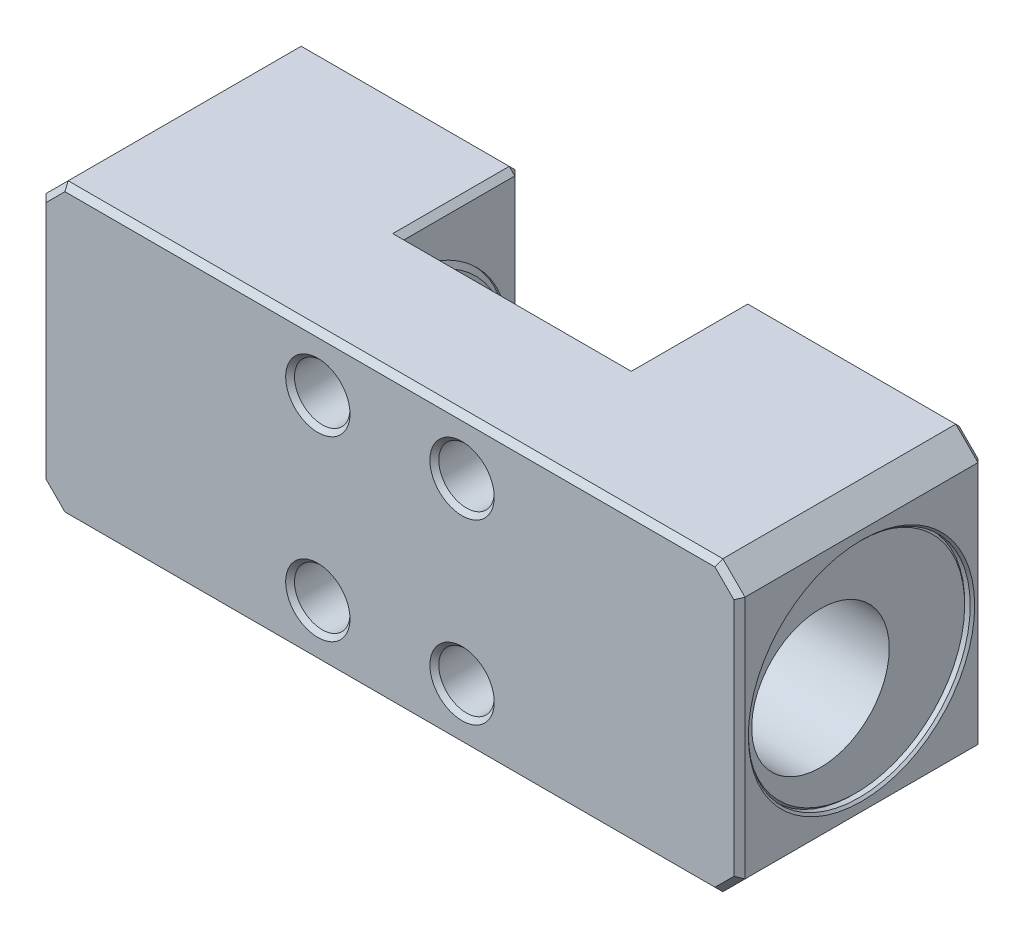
ISO-10303-21;
HEADER;
FILE_DESCRIPTION(('STEP AP214'),'2;1');
FILE_NAME('part.step','',(''),(''),'','','');
FILE_SCHEMA(('AUTOMOTIVE_DESIGN { 1 0 10303 214 1 1 1 1 }'));
ENDSEC;
DATA;
#1=APPLICATION_CONTEXT('core data for automotive mechanical design processes');
#2=APPLICATION_PROTOCOL_DEFINITION('international standard','automotive_design',2000,#1);
#3=PRODUCT_CONTEXT('',#1,'mechanical');
#4=PRODUCT('Part','Part','',(#3));
#5=PRODUCT_RELATED_PRODUCT_CATEGORY('part','',(#4));
#6=PRODUCT_DEFINITION_FORMATION('','',#4);
#7=PRODUCT_DEFINITION_CONTEXT('part definition',#1,'design');
#8=PRODUCT_DEFINITION('design','',#6,#7);
#9=PRODUCT_DEFINITION_SHAPE('','',#8);
#10=(LENGTH_UNIT() NAMED_UNIT(*) SI_UNIT(.MILLI.,.METRE.));
#11=(NAMED_UNIT(*) PLANE_ANGLE_UNIT() SI_UNIT($,.RADIAN.));
#12=(NAMED_UNIT(*) SI_UNIT($,.STERADIAN.) SOLID_ANGLE_UNIT());
#13=UNCERTAINTY_MEASURE_WITH_UNIT(LENGTH_MEASURE(1.E-05),#10,'distance_accuracy_value','');
#14=(GEOMETRIC_REPRESENTATION_CONTEXT(3) GLOBAL_UNCERTAINTY_ASSIGNED_CONTEXT((#13)) GLOBAL_UNIT_ASSIGNED_CONTEXT((#10,
#11,#12)) REPRESENTATION_CONTEXT('',''));
#15=CARTESIAN_POINT('',(0.,0.,0.));
#16=DIRECTION('',(0.,0.,1.));
#17=DIRECTION('',(1.,0.,0.));
#18=AXIS2_PLACEMENT_3D('',#15,#16,#17);
#19=CARTESIAN_POINT('',(6.5,-8.,-6.5));
#20=DIRECTION('',(0.,0.,1.));
#21=DIRECTION('',(-1.,0.,0.));
#22=AXIS2_PLACEMENT_3D('',#19,#20,#21);
#23=CYLINDRICAL_SURFACE('',#22,2.5);
#24=CARTESIAN_POINT('',(6.5,-8.,11.1));
#25=DIRECTION('',(0.,0.,1.));
#26=DIRECTION('',(-1.,0.,0.));
#27=AXIS2_PLACEMENT_3D('',#24,#25,#26);
#28=CIRCLE('',#27,2.5);
#29=CARTESIAN_POINT('',(4.,-8.,11.1));
#30=VERTEX_POINT('',#29);
#31=EDGE_CURVE('E451',#30,#30,#28,.F.);
#32=ORIENTED_EDGE('',*,*,#31,.F.);
#33=EDGE_LOOP('',(#32));
#34=FACE_BOUND('',#33,.T.);
#35=CARTESIAN_POINT('',(6.5,-8.,1.5));
#36=DIRECTION('',(0.,0.,-1.));
#37=DIRECTION('',(-1.,0.,0.));
#38=AXIS2_PLACEMENT_3D('',#35,#36,#37);
#39=CIRCLE('',#38,2.5);
#40=CARTESIAN_POINT('',(4.,-8.,1.5));
#41=VERTEX_POINT('',#40);
#42=EDGE_CURVE('E9',#41,#41,#39,.F.);
#43=ORIENTED_EDGE('',*,*,#42,.F.);
#44=EDGE_LOOP('',(#43));
#45=FACE_BOUND('',#44,.T.);
#46=ADVANCED_FACE('F14',(#34,#45),#23,.F.);
#47=CARTESIAN_POINT('',(-6.5,-8.,-6.5));
#48=DIRECTION('',(0.,0.,1.));
#49=DIRECTION('',(-1.,0.,0.));
#50=AXIS2_PLACEMENT_3D('',#47,#48,#49);
#51=CYLINDRICAL_SURFACE('',#50,2.5);
#52=CARTESIAN_POINT('',(-6.5,-8.,11.1));
#53=DIRECTION('',(0.,0.,1.));
#54=DIRECTION('',(-1.,0.,0.));
#55=AXIS2_PLACEMENT_3D('',#52,#53,#54);
#56=CIRCLE('',#55,2.5);
#57=CARTESIAN_POINT('',(-9.,-8.,11.1));
#58=VERTEX_POINT('',#57);
#59=EDGE_CURVE('E522',#58,#58,#56,.F.);
#60=ORIENTED_EDGE('',*,*,#59,.F.);
#61=EDGE_LOOP('',(#60));
#62=FACE_BOUND('',#61,.T.);
#63=CARTESIAN_POINT('',(-6.5,-8.,1.5));
#64=DIRECTION('',(0.,0.,-1.));
#65=DIRECTION('',(-1.,0.,0.));
#66=AXIS2_PLACEMENT_3D('',#63,#64,#65);
#67=CIRCLE('',#66,2.5);
#68=CARTESIAN_POINT('',(-9.,-8.,1.5));
#69=VERTEX_POINT('',#68);
#70=EDGE_CURVE('E22',#69,#69,#67,.F.);
#71=ORIENTED_EDGE('',*,*,#70,.F.);
#72=EDGE_LOOP('',(#71));
#73=FACE_BOUND('',#72,.T.);
#74=ADVANCED_FACE('F540',(#62,#73),#51,.F.);
#75=CARTESIAN_POINT('',(-6.5,8.,-6.5));
#76=DIRECTION('',(0.,0.,1.));
#77=DIRECTION('',(-1.,0.,0.));
#78=AXIS2_PLACEMENT_3D('',#75,#76,#77);
#79=CYLINDRICAL_SURFACE('',#78,2.5);
#80=CARTESIAN_POINT('',(-6.5,8.,11.1));
#81=DIRECTION('',(0.,0.,1.));
#82=DIRECTION('',(-1.,0.,0.));
#83=AXIS2_PLACEMENT_3D('',#80,#81,#82);
#84=CIRCLE('',#83,2.5);
#85=CARTESIAN_POINT('',(-9.,8.,11.1));
#86=VERTEX_POINT('',#85);
#87=EDGE_CURVE('E525',#86,#86,#84,.F.);
#88=ORIENTED_EDGE('',*,*,#87,.F.);
#89=EDGE_LOOP('',(#88));
#90=FACE_BOUND('',#89,.T.);
#91=CARTESIAN_POINT('',(-6.5,8.,1.5));
#92=DIRECTION('',(0.,0.,-1.));
#93=DIRECTION('',(-1.,0.,0.));
#94=AXIS2_PLACEMENT_3D('',#91,#92,#93);
#95=CIRCLE('',#94,2.5);
#96=CARTESIAN_POINT('',(-9.,8.,1.5));
#97=VERTEX_POINT('',#96);
#98=EDGE_CURVE('E533',#97,#97,#95,.F.);
#99=ORIENTED_EDGE('',*,*,#98,.F.);
#100=EDGE_LOOP('',(#99));
#101=FACE_BOUND('',#100,.T.);
#102=ADVANCED_FACE('F542',(#90,#101),#79,.F.);
#103=CARTESIAN_POINT('',(6.5,8.,-6.5));
#104=DIRECTION('',(0.,0.,1.));
#105=DIRECTION('',(-1.,0.,0.));
#106=AXIS2_PLACEMENT_3D('',#103,#104,#105);
#107=CYLINDRICAL_SURFACE('',#106,2.5);
#108=CARTESIAN_POINT('',(6.5,8.,11.1));
#109=DIRECTION('',(0.,0.,1.));
#110=DIRECTION('',(-1.,0.,0.));
#111=AXIS2_PLACEMENT_3D('',#108,#109,#110);
#112=CIRCLE('',#111,2.5);
#113=CARTESIAN_POINT('',(4.,8.,11.1));
#114=VERTEX_POINT('',#113);
#115=EDGE_CURVE('E528',#114,#114,#112,.F.);
#116=ORIENTED_EDGE('',*,*,#115,.F.);
#117=EDGE_LOOP('',(#116));
#118=FACE_BOUND('',#117,.T.);
#119=CARTESIAN_POINT('',(6.5,8.,1.5));
#120=DIRECTION('',(0.,0.,-1.));
#121=DIRECTION('',(-1.,0.,0.));
#122=AXIS2_PLACEMENT_3D('',#119,#120,#121);
#123=CIRCLE('',#122,2.5);
#124=CARTESIAN_POINT('',(4.,8.,1.5));
#125=VERTEX_POINT('',#124);
#126=EDGE_CURVE('E235',#125,#125,#123,.F.);
#127=ORIENTED_EDGE('',*,*,#126,.F.);
#128=EDGE_LOOP('',(#127));
#129=FACE_BOUND('',#128,.T.);
#130=ADVANCED_FACE('F551',(#118,#129),#107,.F.);
#131=CARTESIAN_POINT('',(-9.7,0.,0.5));
#132=DIRECTION('',(-1.,0.,0.));
#133=DIRECTION('',(0.,0.,-1.));
#134=AXIS2_PLACEMENT_3D('',#131,#132,#133);
#135=CYLINDRICAL_SURFACE('',#134,10.);
#136=DIRECTION('',(-1.,0.,0.));
#137=VECTOR('',#136,1.);
#138=CARTESIAN_POINT('',(-9.7,9.98749217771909,0.));
#139=LINE('',#138,#137);
#140=CARTESIAN_POINT('',(-10.5,9.98749217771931,0.));
#141=VERTEX_POINT('',#140);
#142=CARTESIAN_POINT('',(-10.25,9.98749217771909,0.));
#143=VERTEX_POINT('',#142);
#144=EDGE_CURVE('E977',#141,#143,#139,.F.);
#145=ORIENTED_EDGE('',*,*,#144,.F.);
#146=CARTESIAN_POINT('',(-10.5,2.13572864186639E-13,0.499999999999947));
#147=DIRECTION('',(1.,0.,0.));
#148=DIRECTION('',(0.,1.,0.));
#149=AXIS2_PLACEMENT_3D('',#146,#147,#148);
#150=CIRCLE('',#149,10.);
#151=CARTESIAN_POINT('',(-10.5,-9.98749217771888,0.));
#152=VERTEX_POINT('',#151);
#153=EDGE_CURVE('E236',#141,#152,#150,.F.);
#154=ORIENTED_EDGE('',*,*,#153,.T.);
#155=DIRECTION('',(-1.,0.,0.));
#156=VECTOR('',#155,1.);
#157=CARTESIAN_POINT('',(-9.7,-9.98749217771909,0.));
#158=LINE('',#157,#156);
#159=CARTESIAN_POINT('',(-10.25,-9.98749217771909,0.));
#160=VERTEX_POINT('',#159);
#161=EDGE_CURVE('E243',#160,#152,#158,.T.);
#162=ORIENTED_EDGE('',*,*,#161,.F.);
#163=CARTESIAN_POINT('',(-10.25,0.,0.5));
#164=DIRECTION('',(-1.,0.,0.));
#165=DIRECTION('',(0.,0.,-1.));
#166=AXIS2_PLACEMENT_3D('',#163,#164,#165);
#167=CIRCLE('',#166,10.);
#168=EDGE_CURVE('E277',#143,#160,#167,.T.);
#169=ORIENTED_EDGE('',*,*,#168,.F.);
#170=EDGE_LOOP('',(#145,#154,#162,#169));
#171=FACE_BOUND('',#170,.T.);
#172=ADVANCED_FACE('F566',(#171),#135,.F.);
#173=CARTESIAN_POINT('',(-10.,2.13753303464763E-13,0.499999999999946));
#174=DIRECTION('',(-1.,0.,0.));
#175=DIRECTION('',(0.,-1.,0.));
#176=AXIS2_PLACEMENT_3D('',#173,#174,#175);
#177=CONICAL_SURFACE('',#176,9.5,0.78539816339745);
#178=ORIENTED_EDGE('',*,*,#153,.F.);
#179=CARTESIAN_POINT('',(-22.5039494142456,21.998267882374,0.));
#180=CARTESIAN_POINT('',(-21.7453221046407,21.2394430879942,0.));
#181=CARTESIAN_POINT('',(-20.9867034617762,20.4806096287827,0.));
#182=CARTESIAN_POINT('',(-19.4694944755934,18.96291399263,0.));
#183=CARTESIAN_POINT('',(-18.7109041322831,18.2040518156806,0.));
#184=CARTESIAN_POINT('',(-17.1937581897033,16.6862828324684,0.));
#185=CARTESIAN_POINT('',(-16.4352025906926,15.9273760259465,0.));
#186=CARTESIAN_POINT('',(-14.9181524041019,14.409501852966,0.));
#187=CARTESIAN_POINT('',(-14.1596578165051,13.650534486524,0.));
#188=CARTESIAN_POINT('',(-12.6411675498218,12.1309043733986,0.));
#189=CARTESIAN_POINT('',(-11.8811720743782,11.3702414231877,0.));
#190=CARTESIAN_POINT('',(-10.3613578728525,9.84873778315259,0.));
#191=CARTESIAN_POINT('',(-9.60153914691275,9.08789709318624,0.));
#192=CARTESIAN_POINT('',(-8.08223895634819,7.56588481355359,0.));
#193=CARTESIAN_POINT('',(-7.32275749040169,6.80471322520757,0.));
#194=CARTESIAN_POINT('',(-6.18422329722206,5.66227115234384,0.));
#195=CARTESIAN_POINT('',(-5.80482681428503,5.28134326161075,0.));
#196=CARTESIAN_POINT('',(-5.04646312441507,4.51906047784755,0.));
#197=CARTESIAN_POINT('',(-4.66749591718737,4.137705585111,0.));
#198=CARTESIAN_POINT('',(-4.18539577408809,3.65134509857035,0.));
#199=CARTESIAN_POINT('',(-4.08181831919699,3.54678028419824,0.));
#200=CARTESIAN_POINT('',(-3.87476330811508,3.33755177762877,0.));
#201=CARTESIAN_POINT('',(-3.77128575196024,3.23288808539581,0.));
#202=CARTESIAN_POINT('',(-3.46109009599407,2.91876344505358,0.));
#203=CARTESIAN_POINT('',(-3.2545584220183,2.70911794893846,0.));
#204=CARTESIAN_POINT('',(-2.91068706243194,2.35842236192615,0.));
#205=CARTESIAN_POINT('',(-2.77307539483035,2.21763901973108,0.));
#206=CARTESIAN_POINT('',(-2.4985394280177,1.93527480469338,0.));
#207=CARTESIAN_POINT('',(-2.36161547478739,1.79369359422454,0.));
#208=CARTESIAN_POINT('',(-2.13426457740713,1.55613896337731,0.));
#209=CARTESIAN_POINT('',(-2.04342779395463,1.46055841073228,0.));
#210=CARTESIAN_POINT('',(-1.86302107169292,1.26844230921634,0.));
#211=CARTESIAN_POINT('',(-1.77344960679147,1.17190820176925,0.));
#212=CARTESIAN_POINT('',(-1.62582463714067,1.00907845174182,0.));
#213=CARTESIAN_POINT('',(-1.56715131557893,0.943349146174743,0.));
#214=CARTESIAN_POINT('',(-1.4803724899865,0.843444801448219,0.));
#215=CARTESIAN_POINT('',(-1.4515943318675,0.809855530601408,0.));
#216=CARTESIAN_POINT('',(-1.3946731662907,0.742144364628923,0.));
#217=CARTESIAN_POINT('',(-1.36653011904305,0.708022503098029,0.));
#218=CARTESIAN_POINT('',(-1.31090033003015,0.638741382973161,0.));
#219=CARTESIAN_POINT('',(-1.2834216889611,0.603575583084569,0.));
#220=CARTESIAN_POINT('',(-1.22985401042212,0.53220755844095,0.));
#221=CARTESIAN_POINT('',(-1.20376448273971,0.496005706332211,0.));
#222=CARTESIAN_POINT('',(-1.15389486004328,0.422274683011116,0.));
#223=CARTESIAN_POINT('',(-1.13010441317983,0.384752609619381,0.));
#224=CARTESIAN_POINT('',(-1.08620896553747,0.307647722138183,0.));
#225=CARTESIAN_POINT('',(-1.06609422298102,0.268070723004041,0.));
#226=CARTESIAN_POINT('',(-1.03648497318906,0.196442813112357,0.));
#227=CARTESIAN_POINT('',(-1.02559222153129,0.1649919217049,0.));
#228=CARTESIAN_POINT('',(-1.00912838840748,0.100802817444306,0.));
#229=CARTESIAN_POINT('',(-1.00353152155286,0.068071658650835,0.));
#230=CARTESIAN_POINT('',(-0.998905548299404,0.00178561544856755,0.));
#231=CARTESIAN_POINT('',(-0.999942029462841,-0.0317742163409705,0.));
#232=CARTESIAN_POINT('',(-1.00845880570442,-0.0981193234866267,0.));
#233=CARTESIAN_POINT('',(-1.01596092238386,-0.13090158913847,0.));
#234=CARTESIAN_POINT('',(-1.03327632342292,-0.186831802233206,0.));
#235=CARTESIAN_POINT('',(-1.04203398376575,-0.210329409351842,0.));
#236=CARTESIAN_POINT('',(-1.06155828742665,-0.256485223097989,0.));
#237=CARTESIAN_POINT('',(-1.07232645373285,-0.279142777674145,0.));
#238=CARTESIAN_POINT('',(-1.09537701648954,-0.323792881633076,0.));
#239=CARTESIAN_POINT('',(-1.1076661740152,-0.345781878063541,0.));
#240=CARTESIAN_POINT('',(-1.1333233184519,-0.389102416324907,0.));
#241=CARTESIAN_POINT('',(-1.1466908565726,-0.41043422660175,0.));
#242=CARTESIAN_POINT('',(-1.19322042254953,-0.481680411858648,0.));
#243=CARTESIAN_POINT('',(-1.22822421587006,-0.530383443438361,0.));
#244=CARTESIAN_POINT('',(-1.30058802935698,-0.626019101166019,0.));
#245=CARTESIAN_POINT('',(-1.33795023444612,-0.672950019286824,0.));
#246=CARTESIAN_POINT('',(-1.41417000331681,-0.765773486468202,0.));
#247=CARTESIAN_POINT('',(-1.45303104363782,-0.811663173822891,0.));
#248=CARTESIAN_POINT('',(-1.53162661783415,-0.902648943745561,0.));
#249=CARTESIAN_POINT('',(-1.57136078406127,-0.94774534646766,0.));
#250=CARTESIAN_POINT('',(-1.65151726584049,-1.03749691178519,0.));
#251=CARTESIAN_POINT('',(-1.69194088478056,-1.08215090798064,0.));
#252=CARTESIAN_POINT('',(-1.77321922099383,-1.17107219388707,0.));
#253=CARTESIAN_POINT('',(-1.81407398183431,-1.21533944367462,0.));
#254=CARTESIAN_POINT('',(-1.93696956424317,-1.34757209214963,0.));
#255=CARTESIAN_POINT('',(-2.01946976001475,-1.43511010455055,0.));
#256=CARTESIAN_POINT('',(-2.18444132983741,-1.60874379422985,0.));
#257=CARTESIAN_POINT('',(-2.26690651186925,-1.69484538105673,0.));
#258=CARTESIAN_POINT('',(-2.43228499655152,-1.86661749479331,0.));
#259=CARTESIAN_POINT('',(-2.51519830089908,-1.95228802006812,0.));
#260=CARTESIAN_POINT('',(-2.76438606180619,-2.208875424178,0.));
#261=CARTESIAN_POINT('',(-2.93110279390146,-2.37936231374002,0.));
#262=CARTESIAN_POINT('',(-3.26524328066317,-2.71985453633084,0.));
#263=CARTESIAN_POINT('',(-3.43266741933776,-2.88985949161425,0.));
#264=CARTESIAN_POINT('',(-3.76787297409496,-3.22951148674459,0.));
#265=CARTESIAN_POINT('',(-3.93565438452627,-3.39915853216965,0.));
#266=CARTESIAN_POINT('',(-4.27081178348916,-3.73758825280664,0.));
#267=CARTESIAN_POINT('',(-4.43818691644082,-3.90637177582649,0.));
#268=CARTESIAN_POINT('',(-4.77309136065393,-4.24378717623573,0.));
#269=CARTESIAN_POINT('',(-4.94062067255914,-4.41241905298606,0.));
#270=CARTESIAN_POINT('',(-5.44329502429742,-4.91808028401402,0.));
#271=CARTESIAN_POINT('',(-5.77860061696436,-5.25495000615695,0.));
#272=CARTESIAN_POINT('',(-6.79260461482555,-6.2730067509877,0.));
#273=CARTESIAN_POINT('',(-7.47164934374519,-6.95384869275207,0.));
#274=CARTESIAN_POINT('',(-8.83009160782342,-8.31518127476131,0.));
#275=CARTESIAN_POINT('',(-9.50948914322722,-8.99567191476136,0.));
#276=CARTESIAN_POINT('',(-10.8685375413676,-10.356535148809,0.));
#277=CARTESIAN_POINT('',(-11.5481884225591,-11.0369077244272,0.));
#278=CARTESIAN_POINT('',(-12.9075942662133,-12.3975485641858,0.));
#279=CARTESIAN_POINT('',(-13.5873492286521,-13.07781682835,0.));
#280=CARTESIAN_POINT('',(-15.6398366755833,-15.1316623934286,0.));
#281=CARTESIAN_POINT('',(-17.0126668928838,-16.5051420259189,0.));
#282=CARTESIAN_POINT('',(-19.0719291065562,-18.5652061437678,0.));
#283=CARTESIAN_POINT('',(-19.7583180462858,-19.2518336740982,0.));
#284=CARTESIAN_POINT('',(-21.1311184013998,-20.62506615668,0.));
#285=CARTESIAN_POINT('',(-21.8175298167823,-21.311671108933,0.));
#286=CARTESIAN_POINT('',(-22.5039494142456,-21.9982678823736,0.));
#287=B_SPLINE_CURVE_WITH_KNOTS('',3,(#179,#180,#181,#182,#183,#184,#185,#186,#187,#188,#189,
#190,#191,#192,#193,#194,#195,#196,#197,#198,#199,#200,#201,#202,#203,#204,#205,#206,#207,#208,
#209,#210,#211,#212,#213,#214,#215,#216,#217,#218,#219,#220,#221,#222,#223,#224,#225,#226,#227,
#228,#229,#230,#231,#232,#233,#234,#235,#236,#237,#238,#239,#240,#241,#242,#243,#244,#245,#246,
#247,#248,#249,#250,#251,#252,#253,#254,#255,#256,#257,#258,#259,#260,#261,#262,#263,#264,#265,
#266,#267,#268,#269,#270,#271,#272,#273,#274,#275,#276,#277,#278,#279,#280,#281,#282,#283,#284,
#285,#286),.UNSPECIFIED.,.F.,.F.,(4,2,2,2,2,2,2,2,2,2,2,2,2,2,2,2,2,2,2,2,2,2,2,2,2,2,2,2,2,2,2,
2,2,2,2,2,2,2,2,2,2,2,2,2,2,2,2,2,2,2,2,2,2,4),(0.,3.21900204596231,6.43800499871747,
9.65702895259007,12.8760520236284,16.1018559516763,19.3276624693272,22.5534562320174,
24.1663510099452,25.7792446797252,26.2207859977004,26.6623274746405,27.5451949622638,
28.1357973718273,28.7266719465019,29.1222465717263,29.5172943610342,29.7815942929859,
29.9142832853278,30.046963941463,30.1808289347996,30.3146463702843,30.4478300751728,
30.5806555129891,30.6801883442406,30.7792340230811,30.8792605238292,30.9796259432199,
31.0547521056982,31.1299354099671,31.2054658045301,31.2809649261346,31.4607299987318,
31.640664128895,31.8210441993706,32.0013497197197,32.1820455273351,32.3627597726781,
32.7236152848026,33.0812808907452,33.4389478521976,34.1543059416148,34.8701215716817,
35.5859259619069,36.2990323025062,37.0121416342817,38.4380444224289,41.3228017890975,
44.2075611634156,47.0926069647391,49.9776521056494,55.8034551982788,58.7160630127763,
61.6286705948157),.UNSPECIFIED.);
#288=CARTESIAN_POINT('',(-10.,9.48683298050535,0.));
#289=VERTEX_POINT('',#288);
#290=EDGE_CURVE('E228',#141,#289,#287,.T.);
#291=ORIENTED_EDGE('',*,*,#290,.T.);
#292=CARTESIAN_POINT('',(-10.,2.13753303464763E-13,0.499999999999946));
#293=DIRECTION('',(1.,0.,0.));
#294=DIRECTION('',(0.,1.,0.));
#295=AXIS2_PLACEMENT_3D('',#292,#293,#294);
#296=CIRCLE('',#295,9.5);
#297=CARTESIAN_POINT('',(-10.,-9.48683298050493,0.));
#298=VERTEX_POINT('',#297);
#299=EDGE_CURVE('E241',#298,#289,#296,.T.);
#300=ORIENTED_EDGE('',*,*,#299,.F.);
#301=EDGE_CURVE('E231',#298,#152,#287,.T.);
#302=ORIENTED_EDGE('',*,*,#301,.T.);
#303=EDGE_LOOP('',(#178,#291,#300,#302));
#304=FACE_BOUND('',#303,.T.);
#305=ADVANCED_FACE('F240',(#304),#177,.T.);
#306=CARTESIAN_POINT('',(-10.,2.13753303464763E-13,0.499999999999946));
#307=DIRECTION('',(1.,0.,0.));
#308=DIRECTION('',(0.,1.,0.));
#309=AXIS2_PLACEMENT_3D('',#306,#307,#308);
#310=PLANE('',#309);
#311=ORIENTED_EDGE('',*,*,#299,.T.);
#312=DIRECTION('',(0.,-1.,0.));
#313=VECTOR('',#312,1.);
#314=CARTESIAN_POINT('',(-10.,2.13753303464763E-13,0.));
#315=LINE('',#314,#313);
#316=EDGE_CURVE('E223',#289,#298,#315,.T.);
#317=ORIENTED_EDGE('',*,*,#316,.T.);
#318=EDGE_LOOP('',(#311,#317));
#319=FACE_BOUND('',#318,.T.);
#320=ADVANCED_FACE('F245',(#319),#310,.T.);
#321=CARTESIAN_POINT('',(31.,1.48893295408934E-13,0.5));
#322=DIRECTION('',(1.,0.,0.));
#323=DIRECTION('',(0.,1.,0.));
#324=AXIS2_PLACEMENT_3D('',#321,#322,#323);
#325=PLANE('',#324);
#326=CARTESIAN_POINT('',(31.,1.48893295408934E-13,0.5));
#327=DIRECTION('',(1.,0.,0.));
#328=DIRECTION('',(0.,1.,0.));
#329=AXIS2_PLACEMENT_3D('',#326,#327,#328);
#330=CIRCLE('',#329,9.8);
#331=CARTESIAN_POINT('',(31.,9.80000000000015,0.500000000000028));
#332=VERTEX_POINT('',#331);
#333=EDGE_CURVE('E256',#332,#332,#330,.T.);
#334=ORIENTED_EDGE('',*,*,#333,.T.);
#335=EDGE_LOOP('',(#334));
#336=FACE_BOUND('',#335,.T.);
#337=CARTESIAN_POINT('',(31.,0.,3.70000000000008));
#338=DIRECTION('',(-1.,0.,0.));
#339=DIRECTION('',(0.,0.,-1.));
#340=AXIS2_PLACEMENT_3D('',#337,#338,#339);
#341=CIRCLE('',#340,6.2);
#342=CARTESIAN_POINT('',(31.,0.,-2.49999999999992));
#343=VERTEX_POINT('',#342);
#344=EDGE_CURVE('E978',#343,#343,#341,.T.);
#345=ORIENTED_EDGE('',*,*,#344,.T.);
#346=EDGE_LOOP('',(#345));
#347=FACE_BOUND('',#346,.T.);
#348=ADVANCED_FACE('F561',(#336,#347),#325,.T.);
#349=CARTESIAN_POINT('',(31.,1.48893295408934E-13,0.5));
#350=DIRECTION('',(-1.,0.,0.));
#351=DIRECTION('',(0.,-1.,0.));
#352=AXIS2_PLACEMENT_3D('',#349,#350,#351);
#353=CONICAL_SURFACE('',#352,9.8,0.785398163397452);
#354=CARTESIAN_POINT('',(30.8,1.4876121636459E-13,0.5));
#355=DIRECTION('',(1.,0.,0.));
#356=DIRECTION('',(0.,1.,0.));
#357=AXIS2_PLACEMENT_3D('',#354,#355,#356);
#358=CIRCLE('',#357,10.);
#359=CARTESIAN_POINT('',(30.8,10.0000000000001,0.500000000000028));
#360=VERTEX_POINT('',#359);
#361=EDGE_CURVE('E259',#360,#360,#358,.F.);
#362=ORIENTED_EDGE('',*,*,#361,.F.);
#363=EDGE_LOOP('',(#362));
#364=FACE_BOUND('',#363,.T.);
#365=ORIENTED_EDGE('',*,*,#333,.F.);
#366=EDGE_LOOP('',(#365));
#367=FACE_BOUND('',#366,.T.);
#368=ADVANCED_FACE('F682',(#364,#367),#353,.T.);
#369=CARTESIAN_POINT('',(9.7,0.,0.5));
#370=DIRECTION('',(1.,0.,0.));
#371=DIRECTION('',(0.,0.,1.));
#372=AXIS2_PLACEMENT_3D('',#369,#370,#371);
#373=CYLINDRICAL_SURFACE('',#372,10.);
#374=ORIENTED_EDGE('',*,*,#361,.T.);
#375=EDGE_LOOP('',(#374));
#376=FACE_BOUND('',#375,.T.);
#377=CARTESIAN_POINT('',(31.3,0.,0.5));
#378=DIRECTION('',(-1.,0.,0.));
#379=DIRECTION('',(0.,-1.,0.));
#380=AXIS2_PLACEMENT_3D('',#377,#378,#379);
#381=CIRCLE('',#380,10.);
#382=CARTESIAN_POINT('',(31.3,-10.,0.5));
#383=VERTEX_POINT('',#382);
#384=EDGE_CURVE('E425',#383,#383,#381,.F.);
#385=ORIENTED_EDGE('',*,*,#384,.T.);
#386=EDGE_LOOP('',(#385));
#387=FACE_BOUND('',#386,.T.);
#388=ADVANCED_FACE('F706',(#376,#387),#373,.F.);
#389=CARTESIAN_POINT('',(31.3,0.,0.5));
#390=DIRECTION('',(1.,0.,0.));
#391=DIRECTION('',(0.,1.,0.));
#392=AXIS2_PLACEMENT_3D('',#389,#390,#391);
#393=CONICAL_SURFACE('',#392,10.,0.785398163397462);
#394=CARTESIAN_POINT('',(31.5,0.,0.5));
#395=DIRECTION('',(-1.,0.,0.));
#396=DIRECTION('',(0.,0.,-1.));
#397=AXIS2_PLACEMENT_3D('',#394,#395,#396);
#398=CIRCLE('',#397,10.2);
#399=CARTESIAN_POINT('',(31.5,0.,-9.7));
#400=VERTEX_POINT('',#399);
#401=EDGE_CURVE('E260',#400,#400,#398,.T.);
#402=ORIENTED_EDGE('',*,*,#401,.F.);
#403=EDGE_LOOP('',(#402));
#404=FACE_BOUND('',#403,.T.);
#405=ORIENTED_EDGE('',*,*,#384,.F.);
#406=EDGE_LOOP('',(#405));
#407=FACE_BOUND('',#406,.T.);
#408=ADVANCED_FACE('F16',(#404,#407),#393,.F.);
#409=CARTESIAN_POINT('',(10.,1.35024995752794E-13,0.500000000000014));
#410=DIRECTION('',(-1.,0.,0.));
#411=DIRECTION('',(0.,-1.,0.));
#412=AXIS2_PLACEMENT_3D('',#409,#410,#411);
#413=PLANE('',#412);
#414=DIRECTION('',(0.,-1.,0.));
#415=VECTOR('',#414,1.);
#416=CARTESIAN_POINT('',(10.,1.35024995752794E-13,0.));
#417=LINE('',#416,#415);
#418=CARTESIAN_POINT('',(10.,9.48683298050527,0.));
#419=VERTEX_POINT('',#418);
#420=CARTESIAN_POINT('',(10.,-9.486832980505,0.));
#421=VERTEX_POINT('',#420);
#422=EDGE_CURVE('E35',#419,#421,#417,.T.);
#423=ORIENTED_EDGE('',*,*,#422,.F.);
#424=CARTESIAN_POINT('',(10.,1.35024995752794E-13,0.500000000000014));
#425=DIRECTION('',(-1.,0.,0.));
#426=DIRECTION('',(0.,-1.,0.));
#427=AXIS2_PLACEMENT_3D('',#424,#425,#426);
#428=CIRCLE('',#427,9.5);
#429=EDGE_CURVE('E250',#419,#421,#428,.T.);
#430=ORIENTED_EDGE('',*,*,#429,.T.);
#431=EDGE_LOOP('',(#423,#430));
#432=FACE_BOUND('',#431,.T.);
#433=ADVANCED_FACE('F733',(#432),#413,.T.);
#434=CARTESIAN_POINT('',(10.25,-13.,-10.5));
#435=DIRECTION('',(0.,0.,1.));
#436=DIRECTION('',(-1.,0.,0.));
#437=AXIS2_PLACEMENT_3D('',#434,#435,#436);
#438=PLANE('',#437);
#439=DIRECTION('',(-1.,0.,0.));
#440=VECTOR('',#439,1.);
#441=CARTESIAN_POINT('',(10.25,-12.5,-10.5));
#442=LINE('',#441,#440);
#443=CARTESIAN_POINT('',(29.2928932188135,-12.5,-10.5));
#444=VERTEX_POINT('',#443);
#445=CARTESIAN_POINT('',(10.75,-12.5,-10.5));
#446=VERTEX_POINT('',#445);
#447=EDGE_CURVE('E401',#444,#446,#442,.T.);
#448=ORIENTED_EDGE('',*,*,#447,.T.);
#449=DIRECTION('',(0.,1.,0.));
#450=VECTOR('',#449,1.);
#451=CARTESIAN_POINT('',(10.75,-13.,-10.5));
#452=LINE('',#451,#450);
#453=CARTESIAN_POINT('',(10.75,12.5,-10.5));
#454=VERTEX_POINT('',#453);
#455=EDGE_CURVE('E411',#446,#454,#452,.T.);
#456=ORIENTED_EDGE('',*,*,#455,.T.);
#457=DIRECTION('',(1.,0.,0.));
#458=VECTOR('',#457,1.);
#459=CARTESIAN_POINT('',(10.25,12.5,-10.5));
#460=LINE('',#459,#458);
#461=CARTESIAN_POINT('',(29.2928932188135,12.5,-10.5));
#462=VERTEX_POINT('',#461);
#463=EDGE_CURVE('E409',#454,#462,#460,.T.);
#464=ORIENTED_EDGE('',*,*,#463,.T.);
#465=DIRECTION('',(0.707106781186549,-0.707106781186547,0.));
#466=VECTOR('',#465,1.);
#467=CARTESIAN_POINT('',(31.1464466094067,10.6464466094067,-10.5));
#468=LINE('',#467,#466);
#469=CARTESIAN_POINT('',(31.,10.7928932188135,-10.5));
#470=VERTEX_POINT('',#469);
#471=EDGE_CURVE('E407',#462,#470,#468,.T.);
#472=ORIENTED_EDGE('',*,*,#471,.T.);
#473=DIRECTION('',(0.,-1.,0.));
#474=VECTOR('',#473,1.);
#475=CARTESIAN_POINT('',(31.,-13.,-10.5));
#476=LINE('',#475,#474);
#477=CARTESIAN_POINT('',(31.,-10.7928932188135,-10.5));
#478=VERTEX_POINT('',#477);
#479=EDGE_CURVE('E405',#470,#478,#476,.T.);
#480=ORIENTED_EDGE('',*,*,#479,.T.);
#481=DIRECTION('',(-0.707106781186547,-0.707106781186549,0.));
#482=VECTOR('',#481,1.);
#483=CARTESIAN_POINT('',(29.1464466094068,-12.6464466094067,-10.5));
#484=LINE('',#483,#482);
#485=EDGE_CURVE('E403',#478,#444,#484,.T.);
#486=ORIENTED_EDGE('',*,*,#485,.T.);
#487=EDGE_LOOP('',(#448,#456,#464,#472,#480,#486));
#488=FACE_BOUND('',#487,.T.);
#489=ADVANCED_FACE('F729',(#488),#438,.F.);
#490=CARTESIAN_POINT('',(-31.5,-13.,-10.));
#491=DIRECTION('',(0.,-0.70710678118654,-0.707106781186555));
#492=DIRECTION('',(0.,0.707106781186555,-0.70710678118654));
#493=AXIS2_PLACEMENT_3D('',#490,#491,#492);
#494=PLANE('',#493);
#495=DIRECTION('',(0.28108463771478,-0.678598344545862,0.678598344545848));
#496=VECTOR('',#495,1.);
#497=CARTESIAN_POINT('',(24.6804770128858,-1.36464224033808,-21.6353577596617));
#498=LINE('',#497,#496);
#499=CARTESIAN_POINT('',(29.5,-13.,-10.));
#500=VERTEX_POINT('',#499);
#501=EDGE_CURVE('E502',#444,#500,#498,.T.);
#502=ORIENTED_EDGE('',*,*,#501,.T.);
#503=DIRECTION('',(1.,0.,0.));
#504=VECTOR('',#503,1.);
#505=CARTESIAN_POINT('',(29.5,-13.,-10.));
#506=LINE('',#505,#504);
#507=CARTESIAN_POINT('',(10.75,-13.,-10.));
#508=VERTEX_POINT('',#507);
#509=EDGE_CURVE('E349',#508,#500,#506,.T.);
#510=ORIENTED_EDGE('',*,*,#509,.F.);
#511=DIRECTION('',(0.,-0.707106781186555,0.70710678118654));
#512=VECTOR('',#511,1.);
#513=CARTESIAN_POINT('',(10.75,-12.75,-10.25));
#514=LINE('',#513,#512);
#515=EDGE_CURVE('E494',#446,#508,#514,.T.);
#516=ORIENTED_EDGE('',*,*,#515,.F.);
#517=ORIENTED_EDGE('',*,*,#447,.F.);
#518=EDGE_LOOP('',(#502,#510,#516,#517));
#519=FACE_BOUND('',#518,.T.);
#520=ADVANCED_FACE('F732',(#519),#494,.T.);
#521=CARTESIAN_POINT('',(10.75,-13.,-10.5));
#522=DIRECTION('',(0.707106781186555,0.,0.70710678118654));
#523=DIRECTION('',(-0.70710678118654,0.,0.707106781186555));
#524=AXIS2_PLACEMENT_3D('',#521,#522,#523);
#525=PLANE('',#524);
#526=DIRECTION('',(0.70710678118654,0.,-0.707106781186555));
#527=VECTOR('',#526,1.);
#528=CARTESIAN_POINT('',(10.75,12.5,-10.5));
#529=LINE('',#528,#527);
#530=CARTESIAN_POINT('',(10.25,12.5,-10.));
#531=VERTEX_POINT('',#530);
#532=EDGE_CURVE('E500',#531,#454,#529,.T.);
#533=ORIENTED_EDGE('',*,*,#532,.T.);
#534=ORIENTED_EDGE('',*,*,#455,.F.);
#535=DIRECTION('',(-0.70710678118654,0.,0.707106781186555));
#536=VECTOR('',#535,1.);
#537=CARTESIAN_POINT('',(10.25,-12.5,-10.));
#538=LINE('',#537,#536);
#539=CARTESIAN_POINT('',(10.25,-12.5,-10.));
#540=VERTEX_POINT('',#539);
#541=EDGE_CURVE('E491',#540,#446,#538,.F.);
#542=ORIENTED_EDGE('',*,*,#541,.F.);
#543=DIRECTION('',(0.,-1.,0.));
#544=VECTOR('',#543,1.);
#545=CARTESIAN_POINT('',(10.25,-13.,-10.));
#546=LINE('',#545,#544);
#547=EDGE_CURVE('E416',#531,#540,#546,.T.);
#548=ORIENTED_EDGE('',*,*,#547,.F.);
#549=EDGE_LOOP('',(#533,#534,#542,#548));
#550=FACE_BOUND('',#549,.T.);
#551=ADVANCED_FACE('F851',(#550),#525,.F.);
#552=CARTESIAN_POINT('',(10.25,12.5,-10.5));
#553=DIRECTION('',(0.,-0.70710678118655,0.707106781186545));
#554=DIRECTION('',(0.,-0.707106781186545,-0.70710678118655));
#555=AXIS2_PLACEMENT_3D('',#552,#553,#554);
#556=PLANE('',#555);
#557=DIRECTION('',(0.281084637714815,0.678598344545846,0.67859834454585));
#558=VECTOR('',#557,1.);
#559=CARTESIAN_POINT('',(28.9321508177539,11.629090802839,-11.370909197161));
#560=LINE('',#559,#558);
#561=CARTESIAN_POINT('',(29.5,13.,-10.));
#562=VERTEX_POINT('',#561);
#563=EDGE_CURVE('E511',#562,#462,#560,.F.);
#564=ORIENTED_EDGE('',*,*,#563,.T.);
#565=ORIENTED_EDGE('',*,*,#463,.F.);
#566=DIRECTION('',(0.,0.707106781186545,0.70710678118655));
#567=VECTOR('',#566,1.);
#568=CARTESIAN_POINT('',(10.75,12.5,-10.5));
#569=LINE('',#568,#567);
#570=CARTESIAN_POINT('',(10.75,13.,-10.));
#571=VERTEX_POINT('',#570);
#572=EDGE_CURVE('E505',#571,#454,#569,.F.);
#573=ORIENTED_EDGE('',*,*,#572,.F.);
#574=DIRECTION('',(-1.,0.,0.));
#575=VECTOR('',#574,1.);
#576=CARTESIAN_POINT('',(-31.5,13.,-10.));
#577=LINE('',#576,#575);
#578=EDGE_CURVE('E368',#562,#571,#577,.T.);
#579=ORIENTED_EDGE('',*,*,#578,.F.);
#580=EDGE_LOOP('',(#564,#565,#573,#579));
#581=FACE_BOUND('',#580,.T.);
#582=ADVANCED_FACE('F854',(#581),#556,.F.);
#583=CARTESIAN_POINT('',(32.5214466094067,9.27144660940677,-10.5));
#584=DIRECTION('',(-0.5,-0.5,0.707106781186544));
#585=DIRECTION('',(0.,-0.816496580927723,-0.577350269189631));
#586=AXIS2_PLACEMENT_3D('',#583,#584,#585);
#587=PLANE('',#586);
#588=ORIENTED_EDGE('',*,*,#563,.F.);
#589=DIRECTION('',(0.707106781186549,-0.707106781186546,0.));
#590=VECTOR('',#589,1.);
#591=CARTESIAN_POINT('',(29.5,13.,-10.));
#592=LINE('',#591,#590);
#593=CARTESIAN_POINT('',(31.5,11.,-10.));
#594=VERTEX_POINT('',#593);
#595=EDGE_CURVE('E330',#594,#562,#592,.F.);
#596=ORIENTED_EDGE('',*,*,#595,.F.);
#597=DIRECTION('',(0.678598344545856,0.281084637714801,0.678598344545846));
#598=VECTOR('',#597,1.);
#599=CARTESIAN_POINT('',(26.9221543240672,9.10379423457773,-14.5778456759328));
#600=LINE('',#599,#598);
#601=EDGE_CURVE('E429',#470,#594,#600,.T.);
#602=ORIENTED_EDGE('',*,*,#601,.F.);
#603=ORIENTED_EDGE('',*,*,#471,.F.);
#604=EDGE_LOOP('',(#588,#596,#602,#603));
#605=FACE_BOUND('',#604,.T.);
#606=ADVANCED_FACE('F868',(#605),#587,.F.);
#607=CARTESIAN_POINT('',(31.5,-13.,-10.));
#608=DIRECTION('',(-0.707106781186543,0.,0.707106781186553));
#609=DIRECTION('',(-0.707106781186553,0.,-0.707106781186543));
#610=AXIS2_PLACEMENT_3D('',#607,#608,#609);
#611=PLANE('',#610);
#612=ORIENTED_EDGE('',*,*,#601,.T.);
#613=DIRECTION('',(0.,1.,0.));
#614=VECTOR('',#613,1.);
#615=CARTESIAN_POINT('',(31.5,-13.,-10.));
#616=LINE('',#615,#614);
#617=CARTESIAN_POINT('',(31.5,-11.,-10.));
#618=VERTEX_POINT('',#617);
#619=EDGE_CURVE('E335',#618,#594,#616,.T.);
#620=ORIENTED_EDGE('',*,*,#619,.F.);
#621=DIRECTION('',(-0.678598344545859,0.281084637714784,-0.67859834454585));
#622=VECTOR('',#621,1.);
#623=CARTESIAN_POINT('',(27.9036356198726,-9.51033709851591,-13.5963643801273));
#624=LINE('',#623,#622);
#625=EDGE_CURVE('E508',#478,#618,#624,.F.);
#626=ORIENTED_EDGE('',*,*,#625,.F.);
#627=ORIENTED_EDGE('',*,*,#479,.F.);
#628=EDGE_LOOP('',(#612,#620,#626,#627));
#629=FACE_BOUND('',#628,.T.);
#630=ADVANCED_FACE('F864',(#629),#611,.F.);
#631=CARTESIAN_POINT('',(19.5214466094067,-22.2714466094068,-10.5));
#632=DIRECTION('',(0.500000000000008,-0.500000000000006,-0.707106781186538));
#633=DIRECTION('',(0.816496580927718,0.,0.577350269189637));
#634=AXIS2_PLACEMENT_3D('',#631,#632,#633);
#635=PLANE('',#634);
#636=ORIENTED_EDGE('',*,*,#625,.T.);
#637=DIRECTION('',(0.707106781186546,0.707106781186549,0.));
#638=VECTOR('',#637,1.);
#639=CARTESIAN_POINT('',(31.5,-11.,-10.));
#640=LINE('',#639,#638);
#641=EDGE_CURVE('E339',#500,#618,#640,.T.);
#642=ORIENTED_EDGE('',*,*,#641,.F.);
#643=ORIENTED_EDGE('',*,*,#501,.F.);
#644=ORIENTED_EDGE('',*,*,#485,.F.);
#645=EDGE_LOOP('',(#636,#642,#643,#644));
#646=FACE_BOUND('',#645,.T.);
#647=ADVANCED_FACE('F711',(#646),#635,.T.);
#648=CARTESIAN_POINT('',(-31.5,-13.,-10.5));
#649=DIRECTION('',(0.,-1.,0.));
#650=DIRECTION('',(1.,0.,0.));
#651=AXIS2_PLACEMENT_3D('',#648,#649,#650);
#652=PLANE('',#651);
#653=DIRECTION('',(0.,0.,1.));
#654=VECTOR('',#653,1.);
#655=CARTESIAN_POINT('',(29.5,-13.,11.5));
#656=LINE('',#655,#654);
#657=CARTESIAN_POINT('',(29.5,-13.,11.));
#658=VERTEX_POINT('',#657);
#659=EDGE_CURVE('E301',#500,#658,#656,.T.);
#660=ORIENTED_EDGE('',*,*,#659,.T.);
#661=DIRECTION('',(-1.,0.,0.));
#662=VECTOR('',#661,1.);
#663=CARTESIAN_POINT('',(-29.5,-13.,11.));
#664=LINE('',#663,#662);
#665=CARTESIAN_POINT('',(-29.5,-13.,11.));
#666=VERTEX_POINT('',#665);
#667=EDGE_CURVE('E353',#658,#666,#664,.T.);
#668=ORIENTED_EDGE('',*,*,#667,.T.);
#669=DIRECTION('',(0.,0.,-1.));
#670=VECTOR('',#669,1.);
#671=CARTESIAN_POINT('',(-29.5,-13.,-10.5));
#672=LINE('',#671,#670);
#673=CARTESIAN_POINT('',(-29.5,-13.,-10.));
#674=VERTEX_POINT('',#673);
#675=EDGE_CURVE('E304',#666,#674,#672,.T.);
#676=ORIENTED_EDGE('',*,*,#675,.T.);
#677=DIRECTION('',(1.,0.,0.));
#678=VECTOR('',#677,1.);
#679=CARTESIAN_POINT('',(-10.25,-13.,-10.));
#680=LINE('',#679,#678);
#681=CARTESIAN_POINT('',(-10.75,-13.,-10.));
#682=VERTEX_POINT('',#681);
#683=EDGE_CURVE('E351',#674,#682,#680,.T.);
#684=ORIENTED_EDGE('',*,*,#683,.T.);
#685=DIRECTION('',(0.,0.,1.));
#686=VECTOR('',#685,1.);
#687=CARTESIAN_POINT('',(-10.75,-13.,0.));
#688=LINE('',#687,#686);
#689=CARTESIAN_POINT('',(-10.75,-13.,0.5));
#690=VERTEX_POINT('',#689);
#691=EDGE_CURVE('E345',#682,#690,#688,.T.);
#692=ORIENTED_EDGE('',*,*,#691,.T.);
#693=DIRECTION('',(1.,0.,0.));
#694=VECTOR('',#693,1.);
#695=CARTESIAN_POINT('',(10.25,-13.,0.5));
#696=LINE('',#695,#694);
#697=CARTESIAN_POINT('',(10.75,-13.,0.5));
#698=VERTEX_POINT('',#697);
#699=EDGE_CURVE('E343',#690,#698,#696,.T.);
#700=ORIENTED_EDGE('',*,*,#699,.T.);
#701=DIRECTION('',(0.,0.,-1.));
#702=VECTOR('',#701,1.);
#703=CARTESIAN_POINT('',(10.75,-13.,-10.5));
#704=LINE('',#703,#702);
#705=EDGE_CURVE('E347',#698,#508,#704,.T.);
#706=ORIENTED_EDGE('',*,*,#705,.T.);
#707=ORIENTED_EDGE('',*,*,#509,.T.);
#708=EDGE_LOOP('',(#660,#668,#676,#684,#692,#700,#706,#707));
#709=FACE_BOUND('',#708,.T.);
#710=ADVANCED_FACE('F707',(#709),#652,.T.);
#711=CARTESIAN_POINT('',(10.25,-12.5,-10.));
#712=DIRECTION('',(-0.577350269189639,-0.577350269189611,-0.577350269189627));
#713=DIRECTION('',(0.70710678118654,0.,-0.707106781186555));
#714=AXIS2_PLACEMENT_3D('',#711,#712,#713);
#715=PLANE('',#714);
#716=ORIENTED_EDGE('',*,*,#541,.T.);
#717=ORIENTED_EDGE('',*,*,#515,.T.);
#718=DIRECTION('',(-0.70710678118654,0.707106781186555,0.));
#719=VECTOR('',#718,1.);
#720=CARTESIAN_POINT('',(10.25,-12.5,-10.));
#721=LINE('',#720,#719);
#722=EDGE_CURVE('E485',#540,#508,#721,.F.);
#723=ORIENTED_EDGE('',*,*,#722,.F.);
#724=EDGE_LOOP('',(#716,#717,#723));
#725=FACE_BOUND('',#724,.T.);
#726=ADVANCED_FACE('F710',(#725),#715,.T.);
#727=CARTESIAN_POINT('',(10.75,12.5,-10.5));
#728=DIRECTION('',(-0.577350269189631,0.577350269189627,-0.577350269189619));
#729=DIRECTION('',(-0.707106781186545,-0.70710678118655,0.));
#730=AXIS2_PLACEMENT_3D('',#727,#728,#729);
#731=PLANE('',#730);
#732=DIRECTION('',(-0.70710678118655,-0.707106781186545,0.));
#733=VECTOR('',#732,1.);
#734=CARTESIAN_POINT('',(10.5,12.75,-10.));
#735=LINE('',#734,#733);
#736=EDGE_CURVE('E497',#571,#531,#735,.T.);
#737=ORIENTED_EDGE('',*,*,#736,.F.);
#738=ORIENTED_EDGE('',*,*,#572,.T.);
#739=ORIENTED_EDGE('',*,*,#532,.F.);
#740=EDGE_LOOP('',(#737,#738,#739));
#741=FACE_BOUND('',#740,.T.);
#742=ADVANCED_FACE('F737',(#741),#731,.T.);
#743=CARTESIAN_POINT('',(10.25,-13.,0.));
#744=DIRECTION('',(1.,0.,0.));
#745=DIRECTION('',(0.,0.,1.));
#746=AXIS2_PLACEMENT_3D('',#743,#744,#745);
#747=PLANE('',#746);
#748=DIRECTION('',(0.,1.,0.));
#749=VECTOR('',#748,1.);
#750=CARTESIAN_POINT('',(10.25,-13.,0.));
#751=LINE('',#750,#749);
#752=CARTESIAN_POINT('',(10.25,9.98749217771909,0.));
#753=VERTEX_POINT('',#752);
#754=CARTESIAN_POINT('',(10.25,12.5,0.));
#755=VERTEX_POINT('',#754);
#756=EDGE_CURVE('E283',#753,#755,#751,.T.);
#757=ORIENTED_EDGE('',*,*,#756,.T.);
#758=DIRECTION('',(0.,0.,-1.));
#759=VECTOR('',#758,1.);
#760=CARTESIAN_POINT('',(10.25,12.5,0.));
#761=LINE('',#760,#759);
#762=EDGE_CURVE('E418',#755,#531,#761,.T.);
#763=ORIENTED_EDGE('',*,*,#762,.T.);
#764=ORIENTED_EDGE('',*,*,#547,.T.);
#765=DIRECTION('',(0.,0.,1.));
#766=VECTOR('',#765,1.);
#767=CARTESIAN_POINT('',(10.25,-12.5,0.));
#768=LINE('',#767,#766);
#769=CARTESIAN_POINT('',(10.25,-12.5,0.));
#770=VERTEX_POINT('',#769);
#771=EDGE_CURVE('E414',#540,#770,#768,.T.);
#772=ORIENTED_EDGE('',*,*,#771,.T.);
#773=CARTESIAN_POINT('',(10.25,-9.98749217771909,0.));
#774=VERTEX_POINT('',#773);
#775=EDGE_CURVE('E284',#770,#774,#751,.T.);
#776=ORIENTED_EDGE('',*,*,#775,.T.);
#777=CARTESIAN_POINT('',(10.25,0.,0.5));
#778=DIRECTION('',(1.,0.,0.));
#779=DIRECTION('',(0.,0.,1.));
#780=AXIS2_PLACEMENT_3D('',#777,#778,#779);
#781=CIRCLE('',#780,10.);
#782=EDGE_CURVE('E280',#774,#753,#781,.T.);
#783=ORIENTED_EDGE('',*,*,#782,.T.);
#784=EDGE_LOOP('',(#757,#763,#764,#772,#776,#783));
#785=FACE_BOUND('',#784,.T.);
#786=ADVANCED_FACE('F717',(#785),#747,.F.);
#787=CARTESIAN_POINT('',(-31.5,13.,-10.5));
#788=DIRECTION('',(0.,-1.,0.));
#789=DIRECTION('',(1.,0.,0.));
#790=AXIS2_PLACEMENT_3D('',#787,#788,#789);
#791=PLANE('',#790);
#792=DIRECTION('',(0.,0.,1.));
#793=VECTOR('',#792,1.);
#794=CARTESIAN_POINT('',(-29.5,13.,-10.5));
#795=LINE('',#794,#793);
#796=CARTESIAN_POINT('',(-29.5,13.,-10.));
#797=VERTEX_POINT('',#796);
#798=CARTESIAN_POINT('',(-29.5,13.,11.));
#799=VERTEX_POINT('',#798);
#800=EDGE_CURVE('E298',#797,#799,#795,.T.);
#801=ORIENTED_EDGE('',*,*,#800,.T.);
#802=DIRECTION('',(1.,0.,0.));
#803=VECTOR('',#802,1.);
#804=CARTESIAN_POINT('',(-31.5,13.,11.));
#805=LINE('',#804,#803);
#806=CARTESIAN_POINT('',(29.5,13.,11.));
#807=VERTEX_POINT('',#806);
#808=EDGE_CURVE('E378',#799,#807,#805,.T.);
#809=ORIENTED_EDGE('',*,*,#808,.T.);
#810=DIRECTION('',(0.,0.,-1.));
#811=VECTOR('',#810,1.);
#812=CARTESIAN_POINT('',(29.5,13.,-10.5));
#813=LINE('',#812,#811);
#814=EDGE_CURVE('E295',#807,#562,#813,.T.);
#815=ORIENTED_EDGE('',*,*,#814,.T.);
#816=ORIENTED_EDGE('',*,*,#578,.T.);
#817=DIRECTION('',(0.,0.,1.));
#818=VECTOR('',#817,1.);
#819=CARTESIAN_POINT('',(10.75,13.,-10.5));
#820=LINE('',#819,#818);
#821=CARTESIAN_POINT('',(10.75,13.,0.5));
#822=VERTEX_POINT('',#821);
#823=EDGE_CURVE('E370',#571,#822,#820,.T.);
#824=ORIENTED_EDGE('',*,*,#823,.T.);
#825=DIRECTION('',(-1.,0.,0.));
#826=VECTOR('',#825,1.);
#827=CARTESIAN_POINT('',(-31.5,13.,0.5));
#828=LINE('',#827,#826);
#829=CARTESIAN_POINT('',(-10.75,13.,0.5));
#830=VERTEX_POINT('',#829);
#831=EDGE_CURVE('E372',#822,#830,#828,.T.);
#832=ORIENTED_EDGE('',*,*,#831,.T.);
#833=DIRECTION('',(0.,0.,-1.));
#834=VECTOR('',#833,1.);
#835=CARTESIAN_POINT('',(-10.75,13.,-10.5));
#836=LINE('',#835,#834);
#837=CARTESIAN_POINT('',(-10.75,13.,-10.));
#838=VERTEX_POINT('',#837);
#839=EDGE_CURVE('E374',#830,#838,#836,.T.);
#840=ORIENTED_EDGE('',*,*,#839,.T.);
#841=DIRECTION('',(-1.,0.,0.));
#842=VECTOR('',#841,1.);
#843=CARTESIAN_POINT('',(-31.5,13.,-10.));
#844=LINE('',#843,#842);
#845=EDGE_CURVE('E376',#838,#797,#844,.T.);
#846=ORIENTED_EDGE('',*,*,#845,.T.);
#847=EDGE_LOOP('',(#801,#809,#815,#816,#824,#832,#840,#846));
#848=FACE_BOUND('',#847,.T.);
#849=ADVANCED_FACE('F713',(#848),#791,.F.);
#850=CARTESIAN_POINT('',(31.5,11.,11.5));
#851=DIRECTION('',(-0.707106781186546,-0.707106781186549,0.));
#852=DIRECTION('',(0.707106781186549,-0.707106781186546,0.));
#853=AXIS2_PLACEMENT_3D('',#850,#851,#852);
#854=PLANE('',#853);
#855=ORIENTED_EDGE('',*,*,#814,.F.);
#856=DIRECTION('',(-0.707106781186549,0.707106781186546,0.));
#857=VECTOR('',#856,1.);
#858=CARTESIAN_POINT('',(31.5,11.,11.));
#859=LINE('',#858,#857);
#860=CARTESIAN_POINT('',(31.5,11.,11.));
#861=VERTEX_POINT('',#860);
#862=EDGE_CURVE('E332',#807,#861,#859,.F.);
#863=ORIENTED_EDGE('',*,*,#862,.T.);
#864=DIRECTION('',(0.,0.,1.));
#865=VECTOR('',#864,1.);
#866=CARTESIAN_POINT('',(31.5,11.,11.5));
#867=LINE('',#866,#865);
#868=EDGE_CURVE('E310',#594,#861,#867,.T.);
#869=ORIENTED_EDGE('',*,*,#868,.F.);
#870=ORIENTED_EDGE('',*,*,#595,.T.);
#871=EDGE_LOOP('',(#855,#863,#869,#870));
#872=FACE_BOUND('',#871,.T.);
#873=ADVANCED_FACE('F716',(#872),#854,.F.);
#874=CARTESIAN_POINT('',(31.5,-13.,11.5));
#875=DIRECTION('',(-1.,0.,0.));
#876=DIRECTION('',(0.,0.,-1.));
#877=AXIS2_PLACEMENT_3D('',#874,#875,#876);
#878=PLANE('',#877);
#879=ORIENTED_EDGE('',*,*,#401,.T.);
#880=EDGE_LOOP('',(#879));
#881=FACE_BOUND('',#880,.T.);
#882=ORIENTED_EDGE('',*,*,#868,.T.);
#883=DIRECTION('',(0.,-1.,0.));
#884=VECTOR('',#883,1.);
#885=CARTESIAN_POINT('',(31.5,-13.,11.));
#886=LINE('',#885,#884);
#887=CARTESIAN_POINT('',(31.5,-11.,11.));
#888=VERTEX_POINT('',#887);
#889=EDGE_CURVE('E337',#861,#888,#886,.T.);
#890=ORIENTED_EDGE('',*,*,#889,.T.);
#891=DIRECTION('',(0.,0.,-1.));
#892=VECTOR('',#891,1.);
#893=CARTESIAN_POINT('',(31.5,-11.,-10.5));
#894=LINE('',#893,#892);
#895=EDGE_CURVE('E307',#888,#618,#894,.T.);
#896=ORIENTED_EDGE('',*,*,#895,.T.);
#897=ORIENTED_EDGE('',*,*,#619,.T.);
#898=EDGE_LOOP('',(#882,#890,#896,#897));
#899=FACE_BOUND('',#898,.T.);
#900=ADVANCED_FACE('F724',(#881,#899),#878,.F.);
#901=CARTESIAN_POINT('',(29.5,-13.,-10.5));
#902=DIRECTION('',(0.707106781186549,-0.707106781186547,0.));
#903=DIRECTION('',(0.707106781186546,0.707106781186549,0.));
#904=AXIS2_PLACEMENT_3D('',#901,#902,#903);
#905=PLANE('',#904);
#906=ORIENTED_EDGE('',*,*,#895,.F.);
#907=DIRECTION('',(-0.707106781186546,-0.707106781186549,0.));
#908=VECTOR('',#907,1.);
#909=CARTESIAN_POINT('',(29.5,-13.,11.));
#910=LINE('',#909,#908);
#911=EDGE_CURVE('E341',#888,#658,#910,.T.);
#912=ORIENTED_EDGE('',*,*,#911,.T.);
#913=ORIENTED_EDGE('',*,*,#659,.F.);
#914=ORIENTED_EDGE('',*,*,#641,.T.);
#915=EDGE_LOOP('',(#906,#912,#913,#914));
#916=FACE_BOUND('',#915,.T.);
#917=ADVANCED_FACE('F727',(#916),#905,.T.);
#918=CARTESIAN_POINT('',(-31.5,-13.,11.));
#919=DIRECTION('',(0.,-0.707106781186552,0.707106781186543));
#920=DIRECTION('',(0.,-0.707106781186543,-0.707106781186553));
#921=AXIS2_PLACEMENT_3D('',#918,#919,#920);
#922=PLANE('',#921);
#923=DIRECTION('',(0.281084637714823,0.678598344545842,0.678598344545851));
#924=VECTOR('',#923,1.);
#925=CARTESIAN_POINT('',(-29.1975214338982,-12.2697521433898,11.7302478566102));
#926=LINE('',#925,#924);
#927=CARTESIAN_POINT('',(-29.2928932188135,-12.5,11.5));
#928=VERTEX_POINT('',#927);
#929=EDGE_CURVE('E268',#928,#666,#926,.F.);
#930=ORIENTED_EDGE('',*,*,#929,.T.);
#931=ORIENTED_EDGE('',*,*,#667,.F.);
#932=DIRECTION('',(-0.281084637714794,0.678598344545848,0.678598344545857));
#933=VECTOR('',#932,1.);
#934=CARTESIAN_POINT('',(24.6804770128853,-1.36464224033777,22.6353577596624));
#935=LINE('',#934,#933);
#936=CARTESIAN_POINT('',(29.2928932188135,-12.5,11.5));
#937=VERTEX_POINT('',#936);
#938=EDGE_CURVE('E440',#937,#658,#935,.F.);
#939=ORIENTED_EDGE('',*,*,#938,.F.);
#940=DIRECTION('',(1.,0.,0.));
#941=VECTOR('',#940,1.);
#942=CARTESIAN_POINT('',(29.5,-12.5,11.5));
#943=LINE('',#942,#941);
#944=EDGE_CURVE('E321',#928,#937,#943,.T.);
#945=ORIENTED_EDGE('',*,*,#944,.F.);
#946=EDGE_LOOP('',(#930,#931,#939,#945));
#947=FACE_BOUND('',#946,.T.);
#948=ADVANCED_FACE('F764',(#947),#922,.T.);
#949=CARTESIAN_POINT('',(-29.5,-13.,-10.5));
#950=DIRECTION('',(-0.707106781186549,-0.707106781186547,0.));
#951=DIRECTION('',(0.707106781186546,-0.707106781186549,0.));
#952=AXIS2_PLACEMENT_3D('',#949,#950,#951);
#953=PLANE('',#952);
#954=ORIENTED_EDGE('',*,*,#675,.F.);
#955=DIRECTION('',(-0.707106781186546,0.707106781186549,0.));
#956=VECTOR('',#955,1.);
#957=CARTESIAN_POINT('',(-31.5,-11.,11.));
#958=LINE('',#957,#956);
#959=CARTESIAN_POINT('',(-31.5,-11.,11.));
#960=VERTEX_POINT('',#959);
#961=EDGE_CURVE('E358',#666,#960,#958,.T.);
#962=ORIENTED_EDGE('',*,*,#961,.T.);
#963=DIRECTION('',(0.,0.,1.));
#964=VECTOR('',#963,1.);
#965=CARTESIAN_POINT('',(-31.5,-11.,11.5));
#966=LINE('',#965,#964);
#967=CARTESIAN_POINT('',(-31.5,-11.,-10.));
#968=VERTEX_POINT('',#967);
#969=EDGE_CURVE('E289',#968,#960,#966,.T.);
#970=ORIENTED_EDGE('',*,*,#969,.F.);
#971=DIRECTION('',(0.707106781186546,-0.707106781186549,0.));
#972=VECTOR('',#971,1.);
#973=CARTESIAN_POINT('',(-29.5,-13.,-10.));
#974=LINE('',#973,#972);
#975=EDGE_CURVE('E355',#968,#674,#974,.T.);
#976=ORIENTED_EDGE('',*,*,#975,.T.);
#977=EDGE_LOOP('',(#954,#962,#970,#976));
#978=FACE_BOUND('',#977,.T.);
#979=ADVANCED_FACE('F760',(#978),#953,.T.);
#980=CARTESIAN_POINT('',(-31.5,-13.,-10.));
#981=DIRECTION('',(0.,-0.707106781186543,-0.707106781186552));
#982=DIRECTION('',(0.,0.707106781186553,-0.707106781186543));
#983=AXIS2_PLACEMENT_3D('',#980,#981,#982);
#984=PLANE('',#983);
#985=DIRECTION('',(0.,0.707106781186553,-0.707106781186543));
#986=VECTOR('',#985,1.);
#987=CARTESIAN_POINT('',(-10.75,-13.,-10.));
#988=LINE('',#987,#986);
#989=CARTESIAN_POINT('',(-10.75,-12.5,-10.5));
#990=VERTEX_POINT('',#989);
#991=EDGE_CURVE('E456',#990,#682,#988,.F.);
#992=ORIENTED_EDGE('',*,*,#991,.T.);
#993=ORIENTED_EDGE('',*,*,#683,.F.);
#994=DIRECTION('',(0.281084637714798,0.678598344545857,-0.678598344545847));
#995=VECTOR('',#994,1.);
#996=CARTESIAN_POINT('',(-29.6580171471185,-13.3814871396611,-9.61851286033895));
#997=LINE('',#996,#995);
#998=CARTESIAN_POINT('',(-29.2928932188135,-12.5,-10.5));
#999=VERTEX_POINT('',#998);
#1000=EDGE_CURVE('E450',#999,#674,#997,.F.);
#1001=ORIENTED_EDGE('',*,*,#1000,.F.);
#1002=DIRECTION('',(-1.,0.,0.));
#1003=VECTOR('',#1002,1.);
#1004=CARTESIAN_POINT('',(-29.5,-12.5,-10.5));
#1005=LINE('',#1004,#1003);
#1006=EDGE_CURVE('E388',#990,#999,#1005,.T.);
#1007=ORIENTED_EDGE('',*,*,#1006,.F.);
#1008=EDGE_LOOP('',(#992,#993,#1001,#1007));
#1009=FACE_BOUND('',#1008,.T.);
#1010=ADVANCED_FACE('F763',(#1009),#984,.T.);
#1011=CARTESIAN_POINT('',(-10.75,-13.,-10.5));
#1012=DIRECTION('',(0.707106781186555,-0.70710678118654,0.));
#1013=DIRECTION('',(0.70710678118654,0.707106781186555,0.));
#1014=AXIS2_PLACEMENT_3D('',#1011,#1012,#1013);
#1015=PLANE('',#1014);
#1016=DIRECTION('',(0.577350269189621,0.577350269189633,-0.577350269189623));
#1017=VECTOR('',#1016,1.);
#1018=CARTESIAN_POINT('',(-7.08333333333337,-9.33333333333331,-3.16666666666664));
#1019=LINE('',#1018,#1017);
#1020=CARTESIAN_POINT('',(-10.25,-12.5,0.));
#1021=VERTEX_POINT('',#1020);
#1022=EDGE_CURVE('E473',#1021,#690,#1019,.F.);
#1023=ORIENTED_EDGE('',*,*,#1022,.T.);
#1024=ORIENTED_EDGE('',*,*,#691,.F.);
#1025=DIRECTION('',(-0.70710678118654,-0.707106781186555,0.));
#1026=VECTOR('',#1025,1.);
#1027=CARTESIAN_POINT('',(-10.75,-13.,-10.));
#1028=LINE('',#1027,#1026);
#1029=CARTESIAN_POINT('',(-10.25,-12.5,-10.));
#1030=VERTEX_POINT('',#1029);
#1031=EDGE_CURVE('E465',#1030,#682,#1028,.T.);
#1032=ORIENTED_EDGE('',*,*,#1031,.F.);
#1033=DIRECTION('',(0.,0.,-1.));
#1034=VECTOR('',#1033,1.);
#1035=CARTESIAN_POINT('',(-10.25,-12.5,-10.5));
#1036=LINE('',#1035,#1034);
#1037=EDGE_CURVE('E393',#1021,#1030,#1036,.T.);
#1038=ORIENTED_EDGE('',*,*,#1037,.F.);
#1039=EDGE_LOOP('',(#1023,#1024,#1032,#1038));
#1040=FACE_BOUND('',#1039,.T.);
#1041=ADVANCED_FACE('F810',(#1040),#1015,.T.);
#1042=CARTESIAN_POINT('',(-31.5,-13.,0.5));
#1043=DIRECTION('',(0.,-0.707106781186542,-0.707106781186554));
#1044=DIRECTION('',(0.,0.707106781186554,-0.707106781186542));
#1045=AXIS2_PLACEMENT_3D('',#1042,#1043,#1044);
#1046=PLANE('',#1045);
#1047=DIRECTION('',(0.577350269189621,-0.577350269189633,0.577350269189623));
#1048=VECTOR('',#1047,1.);
#1049=CARTESIAN_POINT('',(7.08333333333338,-9.33333333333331,-3.16666666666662));
#1050=LINE('',#1049,#1048);
#1051=EDGE_CURVE('E479',#770,#698,#1050,.T.);
#1052=ORIENTED_EDGE('',*,*,#1051,.T.);
#1053=ORIENTED_EDGE('',*,*,#699,.F.);
#1054=ORIENTED_EDGE('',*,*,#1022,.F.);
#1055=DIRECTION('',(-1.,0.,0.));
#1056=VECTOR('',#1055,1.);
#1057=CARTESIAN_POINT('',(-10.25,-12.5,0.));
#1058=LINE('',#1057,#1056);
#1059=EDGE_CURVE('E420',#770,#1021,#1058,.T.);
#1060=ORIENTED_EDGE('',*,*,#1059,.F.);
#1061=EDGE_LOOP('',(#1052,#1053,#1054,#1060));
#1062=FACE_BOUND('',#1061,.T.);
#1063=ADVANCED_FACE('F827',(#1062),#1046,.T.);
#1064=CARTESIAN_POINT('',(10.75,-13.,-10.5));
#1065=DIRECTION('',(-0.707106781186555,-0.70710678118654,0.));
#1066=DIRECTION('',(0.70710678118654,-0.707106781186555,0.));
#1067=AXIS2_PLACEMENT_3D('',#1064,#1065,#1066);
#1068=PLANE('',#1067);
#1069=ORIENTED_EDGE('',*,*,#722,.T.);
#1070=ORIENTED_EDGE('',*,*,#705,.F.);
#1071=ORIENTED_EDGE('',*,*,#1051,.F.);
#1072=ORIENTED_EDGE('',*,*,#771,.F.);
#1073=EDGE_LOOP('',(#1069,#1070,#1071,#1072));
#1074=FACE_BOUND('',#1073,.T.);
#1075=ADVANCED_FACE('F834',(#1074),#1068,.T.);
#1076=CARTESIAN_POINT('',(10.25,12.5,0.));
#1077=DIRECTION('',(0.707106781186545,-0.70710678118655,0.));
#1078=DIRECTION('',(0.70710678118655,0.707106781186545,0.));
#1079=AXIS2_PLACEMENT_3D('',#1076,#1077,#1078);
#1080=PLANE('',#1079);
#1081=ORIENTED_EDGE('',*,*,#736,.T.);
#1082=ORIENTED_EDGE('',*,*,#762,.F.);
#1083=DIRECTION('',(0.577350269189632,0.577350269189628,0.577350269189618));
#1084=VECTOR('',#1083,1.);
#1085=CARTESIAN_POINT('',(3.41666666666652,5.66666666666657,-6.8333333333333));
#1086=LINE('',#1085,#1084);
#1087=EDGE_CURVE('E488',#822,#755,#1086,.F.);
#1088=ORIENTED_EDGE('',*,*,#1087,.F.);
#1089=ORIENTED_EDGE('',*,*,#823,.F.);
#1090=EDGE_LOOP('',(#1081,#1082,#1088,#1089));
#1091=FACE_BOUND('',#1090,.T.);
#1092=ADVANCED_FACE('F741',(#1091),#1080,.F.);
#1093=CARTESIAN_POINT('',(-10.25,-13.,0.));
#1094=DIRECTION('',(0.,0.,1.));
#1095=DIRECTION('',(-1.,0.,0.));
#1096=AXIS2_PLACEMENT_3D('',#1093,#1094,#1095);
#1097=PLANE('',#1096);
#1098=DIRECTION('',(1.,0.,0.));
#1099=VECTOR('',#1098,1.);
#1100=CARTESIAN_POINT('',(9.7,-9.98749217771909,0.));
#1101=LINE('',#1100,#1099);
#1102=CARTESIAN_POINT('',(10.5,-9.98749217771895,0.));
#1103=VERTEX_POINT('',#1102);
#1104=EDGE_CURVE('E673',#774,#1103,#1101,.T.);
#1105=ORIENTED_EDGE('',*,*,#1104,.F.);
#1106=ORIENTED_EDGE('',*,*,#775,.F.);
#1107=ORIENTED_EDGE('',*,*,#1059,.T.);
#1108=DIRECTION('',(0.,1.,0.));
#1109=VECTOR('',#1108,1.);
#1110=CARTESIAN_POINT('',(-10.25,-13.,0.));
#1111=LINE('',#1110,#1109);
#1112=EDGE_CURVE('E287',#1021,#160,#1111,.T.);
#1113=ORIENTED_EDGE('',*,*,#1112,.T.);
#1114=ORIENTED_EDGE('',*,*,#161,.T.);
#1115=ORIENTED_EDGE('',*,*,#301,.F.);
#1116=ORIENTED_EDGE('',*,*,#316,.F.);
#1117=ORIENTED_EDGE('',*,*,#290,.F.);
#1118=ORIENTED_EDGE('',*,*,#144,.T.);
#1119=CARTESIAN_POINT('',(-10.25,12.5,0.));
#1120=VERTEX_POINT('',#1119);
#1121=EDGE_CURVE('E286',#143,#1120,#1111,.T.);
#1122=ORIENTED_EDGE('',*,*,#1121,.T.);
#1123=DIRECTION('',(1.,0.,0.));
#1124=VECTOR('',#1123,1.);
#1125=CARTESIAN_POINT('',(-10.25,12.5,0.));
#1126=LINE('',#1125,#1124);
#1127=EDGE_CURVE('E422',#1120,#755,#1126,.T.);
#1128=ORIENTED_EDGE('',*,*,#1127,.T.);
#1129=ORIENTED_EDGE('',*,*,#756,.F.);
#1130=DIRECTION('',(1.,0.,0.));
#1131=VECTOR('',#1130,1.);
#1132=CARTESIAN_POINT('',(9.7,9.98749217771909,0.));
#1133=LINE('',#1132,#1131);
#1134=CARTESIAN_POINT('',(10.5,9.98749217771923,0.));
#1135=VERTEX_POINT('',#1134);
#1136=EDGE_CURVE('E575',#1135,#753,#1133,.F.);
#1137=ORIENTED_EDGE('',*,*,#1136,.F.);
#1138=CARTESIAN_POINT('',(22.5039494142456,21.9982678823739,0.));
#1139=CARTESIAN_POINT('',(21.7453221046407,21.2394430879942,0.));
#1140=CARTESIAN_POINT('',(20.9867034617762,20.4806096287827,0.));
#1141=CARTESIAN_POINT('',(19.4694944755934,18.9629139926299,0.));
#1142=CARTESIAN_POINT('',(18.7109041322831,18.2040518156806,0.));
#1143=CARTESIAN_POINT('',(17.1937581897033,16.6862828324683,0.));
#1144=CARTESIAN_POINT('',(16.4352025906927,15.9273760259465,0.));
#1145=CARTESIAN_POINT('',(14.9181524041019,14.409501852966,0.));
#1146=CARTESIAN_POINT('',(14.1596578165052,13.6505344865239,0.));
#1147=CARTESIAN_POINT('',(12.6411675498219,12.1309043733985,0.));
#1148=CARTESIAN_POINT('',(11.8811720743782,11.3702414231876,0.));
#1149=CARTESIAN_POINT('',(10.3613578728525,9.84873778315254,0.));
#1150=CARTESIAN_POINT('',(9.60153914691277,9.08789709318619,0.));
#1151=CARTESIAN_POINT('',(8.0822389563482,7.56588481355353,0.));
#1152=CARTESIAN_POINT('',(7.3227574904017,6.80471322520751,0.));
#1153=CARTESIAN_POINT('',(6.18422329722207,5.66227115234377,0.));
#1154=CARTESIAN_POINT('',(5.80482681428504,5.28134326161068,0.));
#1155=CARTESIAN_POINT('',(5.04646312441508,4.51906047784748,0.));
#1156=CARTESIAN_POINT('',(4.66749591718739,4.13770558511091,0.));
#1157=CARTESIAN_POINT('',(4.1853957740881,3.65134509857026,0.));
#1158=CARTESIAN_POINT('',(4.081818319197,3.54678028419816,0.));
#1159=CARTESIAN_POINT('',(3.87476330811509,3.33755177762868,0.));
#1160=CARTESIAN_POINT('',(3.77128575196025,3.23288808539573,0.));
#1161=CARTESIAN_POINT('',(3.46109009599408,2.91876344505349,0.));
#1162=CARTESIAN_POINT('',(3.25455842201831,2.70911794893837,0.));
#1163=CARTESIAN_POINT('',(2.91068706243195,2.35842236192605,0.));
#1164=CARTESIAN_POINT('',(2.77307539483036,2.21763901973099,0.));
#1165=CARTESIAN_POINT('',(2.49853942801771,1.93527480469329,0.));
#1166=CARTESIAN_POINT('',(2.3616154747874,1.79369359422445,0.));
#1167=CARTESIAN_POINT('',(2.13426457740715,1.55613896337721,0.));
#1168=CARTESIAN_POINT('',(2.04342779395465,1.46055841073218,0.));
#1169=CARTESIAN_POINT('',(1.86302107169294,1.26844230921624,0.));
#1170=CARTESIAN_POINT('',(1.77344960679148,1.17190820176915,0.));
#1171=CARTESIAN_POINT('',(1.62582463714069,1.00907845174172,0.));
#1172=CARTESIAN_POINT('',(1.56715131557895,0.943349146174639,0.));
#1173=CARTESIAN_POINT('',(1.48037248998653,0.843444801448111,0.));
#1174=CARTESIAN_POINT('',(1.45159433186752,0.809855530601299,0.));
#1175=CARTESIAN_POINT('',(1.39467316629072,0.742144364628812,0.));
#1176=CARTESIAN_POINT('',(1.36653011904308,0.708022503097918,0.));
#1177=CARTESIAN_POINT('',(1.31090033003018,0.638741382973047,0.));
#1178=CARTESIAN_POINT('',(1.28342168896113,0.603575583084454,0.));
#1179=CARTESIAN_POINT('',(1.22985401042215,0.532207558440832,0.));
#1180=CARTESIAN_POINT('',(1.20376448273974,0.496005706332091,0.));
#1181=CARTESIAN_POINT('',(1.15389486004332,0.422274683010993,0.));
#1182=CARTESIAN_POINT('',(1.13010441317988,0.384752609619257,0.));
#1183=CARTESIAN_POINT('',(1.08620896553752,0.307647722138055,0.));
#1184=CARTESIAN_POINT('',(1.06609422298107,0.26807072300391,0.));
#1185=CARTESIAN_POINT('',(1.03648497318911,0.19644281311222,0.));
#1186=CARTESIAN_POINT('',(1.02559222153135,0.16499192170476,0.));
#1187=CARTESIAN_POINT('',(1.00912838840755,0.100802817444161,0.));
#1188=CARTESIAN_POINT('',(1.00353152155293,0.0680716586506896,0.));
#1189=CARTESIAN_POINT('',(0.998905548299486,0.00178561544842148,0.));
#1190=CARTESIAN_POINT('',(0.999942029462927,-0.0317742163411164,0.));
#1191=CARTESIAN_POINT('',(1.00845880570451,-0.0981193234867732,0.));
#1192=CARTESIAN_POINT('',(1.01596092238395,-0.130901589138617,0.));
#1193=CARTESIAN_POINT('',(1.03327632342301,-0.186831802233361,0.));
#1194=CARTESIAN_POINT('',(1.04203398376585,-0.210329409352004,0.));
#1195=CARTESIAN_POINT('',(1.06155828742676,-0.256485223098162,0.));
#1196=CARTESIAN_POINT('',(1.07232645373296,-0.279142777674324,0.));
#1197=CARTESIAN_POINT('',(1.09537701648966,-0.323792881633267,0.));
#1198=CARTESIAN_POINT('',(1.10766617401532,-0.345781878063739,0.));
#1199=CARTESIAN_POINT('',(1.13332331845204,-0.389102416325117,0.));
#1200=CARTESIAN_POINT('',(1.14669085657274,-0.410434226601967,0.));
#1201=CARTESIAN_POINT('',(1.19322042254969,-0.481680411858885,0.));
#1202=CARTESIAN_POINT('',(1.22822421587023,-0.530383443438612,0.));
#1203=CARTESIAN_POINT('',(1.30058802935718,-0.626019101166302,0.));
#1204=CARTESIAN_POINT('',(1.33795023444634,-0.672950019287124,0.));
#1205=CARTESIAN_POINT('',(1.41417000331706,-0.765773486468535,0.));
#1206=CARTESIAN_POINT('',(1.45303104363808,-0.811663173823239,0.));
#1207=CARTESIAN_POINT('',(1.53162661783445,-0.902648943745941,0.));
#1208=CARTESIAN_POINT('',(1.57136078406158,-0.947745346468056,0.));
#1209=CARTESIAN_POINT('',(1.65151726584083,-1.03749691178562,0.));
#1210=CARTESIAN_POINT('',(1.69194088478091,-1.08215090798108,0.));
#1211=CARTESIAN_POINT('',(1.77321922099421,-1.17107219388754,0.));
#1212=CARTESIAN_POINT('',(1.81407398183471,-1.2153394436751,0.));
#1213=CARTESIAN_POINT('',(1.93696956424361,-1.34757209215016,0.));
#1214=CARTESIAN_POINT('',(2.01946976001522,-1.4351101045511,0.));
#1215=CARTESIAN_POINT('',(2.18444132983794,-1.60874379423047,0.));
#1216=CARTESIAN_POINT('',(2.26690651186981,-1.69484538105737,0.));
#1217=CARTESIAN_POINT('',(2.43228499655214,-1.86661749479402,0.));
#1218=CARTESIAN_POINT('',(2.51519830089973,-1.95228802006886,0.));
#1219=CARTESIAN_POINT('',(2.76438606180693,-2.20887542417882,0.));
#1220=CARTESIAN_POINT('',(2.93110279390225,-2.3793623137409,0.));
#1221=CARTESIAN_POINT('',(3.26524328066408,-2.71985453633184,0.));
#1222=CARTESIAN_POINT('',(3.43266741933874,-2.8898594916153,0.));
#1223=CARTESIAN_POINT('',(3.76787297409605,-3.22951148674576,0.));
#1224=CARTESIAN_POINT('',(3.93565438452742,-3.39915853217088,0.));
#1225=CARTESIAN_POINT('',(4.27081178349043,-3.737588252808,0.));
#1226=CARTESIAN_POINT('',(4.43818691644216,-3.90637177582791,0.));
#1227=CARTESIAN_POINT('',(4.77309136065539,-4.24378717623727,0.));
#1228=CARTESIAN_POINT('',(4.94062067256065,-4.41241905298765,0.));
#1229=CARTESIAN_POINT('',(5.44329502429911,-4.91808028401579,0.));
#1230=CARTESIAN_POINT('',(5.77860061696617,-5.25495000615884,0.));
#1231=CARTESIAN_POINT('',(6.79260461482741,-6.27300675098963,0.));
#1232=CARTESIAN_POINT('',(7.47164934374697,-6.95384869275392,0.));
#1233=CARTESIAN_POINT('',(8.83009160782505,-8.31518127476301,0.));
#1234=CARTESIAN_POINT('',(9.50948914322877,-8.99567191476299,0.));
#1235=CARTESIAN_POINT('',(10.868537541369,-10.3565351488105,0.));
#1236=CARTESIAN_POINT('',(11.5481884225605,-11.0369077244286,0.));
#1237=CARTESIAN_POINT('',(12.9075942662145,-12.397548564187,0.));
#1238=CARTESIAN_POINT('',(13.5873492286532,-13.0778168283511,0.));
#1239=CARTESIAN_POINT('',(15.6398366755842,-15.1316623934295,0.));
#1240=CARTESIAN_POINT('',(17.0126668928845,-16.5051420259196,0.));
#1241=CARTESIAN_POINT('',(19.0719291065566,-18.5652061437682,0.));
#1242=CARTESIAN_POINT('',(19.7583180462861,-19.2518336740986,0.));
#1243=CARTESIAN_POINT('',(21.1311184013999,-20.6250661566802,0.));
#1244=CARTESIAN_POINT('',(21.8175298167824,-21.3116711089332,0.));
#1245=CARTESIAN_POINT('',(22.5039494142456,-21.9982678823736,0.));
#1246=B_SPLINE_CURVE_WITH_KNOTS('',3,(#1138,#1139,#1140,#1141,#1142,#1143,#1144,#1145,#1146,
#1147,#1148,#1149,#1150,#1151,#1152,#1153,#1154,#1155,#1156,#1157,#1158,#1159,#1160,#1161,#1162,
#1163,#1164,#1165,#1166,#1167,#1168,#1169,#1170,#1171,#1172,#1173,#1174,#1175,#1176,#1177,#1178,
#1179,#1180,#1181,#1182,#1183,#1184,#1185,#1186,#1187,#1188,#1189,#1190,#1191,#1192,#1193,#1194,
#1195,#1196,#1197,#1198,#1199,#1200,#1201,#1202,#1203,#1204,#1205,#1206,#1207,#1208,#1209,#1210,
#1211,#1212,#1213,#1214,#1215,#1216,#1217,#1218,#1219,#1220,#1221,#1222,#1223,#1224,#1225,#1226,
#1227,#1228,#1229,#1230,#1231,#1232,#1233,#1234,#1235,#1236,#1237,#1238,#1239,#1240,#1241,#1242,
#1243,#1244,#1245),.UNSPECIFIED.,.F.,.F.,(4,2,2,2,2,2,2,2,2,2,2,2,2,2,2,2,2,2,2,2,2,2,2,2,2,2,2,
2,2,2,2,2,2,2,2,2,2,2,2,2,2,2,2,2,2,2,2,2,2,2,2,2,2,4),(0.,3.2190020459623,6.43800499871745,
9.65702895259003,12.8760520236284,16.1018559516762,19.3276624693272,22.5534562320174,
24.1663510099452,25.7792446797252,26.2207859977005,26.6623274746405,27.5451949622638,
28.1357973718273,28.7266719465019,29.1222465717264,29.5172943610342,29.7815942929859,
29.9142832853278,30.046963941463,30.1808289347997,30.3146463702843,30.4478300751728,
30.5806555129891,30.6801883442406,30.7792340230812,30.8792605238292,30.9796259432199,
31.0547521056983,31.1299354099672,31.2054658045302,31.2809649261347,31.460729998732,
31.6406641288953,31.8210441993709,32.0013497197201,32.1820455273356,32.3627597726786,
32.7236152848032,33.081280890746,33.4389478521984,34.1543059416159,34.8701215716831,
35.5859259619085,36.299032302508,37.0121416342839,38.4380444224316,41.3228017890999,
44.2075611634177,47.0926069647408,49.9776521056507,55.8034551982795,58.7160630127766,
61.6286705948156),.UNSPECIFIED.);
#1247=EDGE_CURVE('E674',#1135,#419,#1246,.T.);
#1248=ORIENTED_EDGE('',*,*,#1247,.T.);
#1249=ORIENTED_EDGE('',*,*,#422,.T.);
#1250=EDGE_CURVE('E29',#421,#1103,#1246,.T.);
#1251=ORIENTED_EDGE('',*,*,#1250,.T.);
#1252=EDGE_LOOP('',(#1105,#1106,#1107,#1113,#1114,#1115,#1116,#1117,#1118,#1122,#1128,#1129,
#1137,#1248,#1249,#1251));
#1253=FACE_BOUND('',#1252,.T.);
#1254=CARTESIAN_POINT('',(6.5,8.,0.));
#1255=DIRECTION('',(0.,0.,-1.));
#1256=DIRECTION('',(-1.,0.,0.));
#1257=AXIS2_PLACEMENT_3D('',#1254,#1255,#1256);
#1258=CIRCLE('',#1257,2.05);
#1259=CARTESIAN_POINT('',(4.45,8.,0.));
#1260=VERTEX_POINT('',#1259);
#1261=EDGE_CURVE('E660',#1260,#1260,#1258,.T.);
#1262=ORIENTED_EDGE('',*,*,#1261,.F.);
#1263=EDGE_LOOP('',(#1262));
#1264=FACE_BOUND('',#1263,.T.);
#1265=CARTESIAN_POINT('',(-6.5,8.,0.));
#1266=DIRECTION('',(0.,0.,-1.));
#1267=DIRECTION('',(-1.,0.,0.));
#1268=AXIS2_PLACEMENT_3D('',#1265,#1266,#1267);
#1269=CIRCLE('',#1268,2.05);
#1270=CARTESIAN_POINT('',(-8.55,8.,0.));
#1271=VERTEX_POINT('',#1270);
#1272=EDGE_CURVE('E654',#1271,#1271,#1269,.T.);
#1273=ORIENTED_EDGE('',*,*,#1272,.F.);
#1274=EDGE_LOOP('',(#1273));
#1275=FACE_BOUND('',#1274,.T.);
#1276=CARTESIAN_POINT('',(-6.5,-8.,0.));
#1277=DIRECTION('',(0.,0.,-1.));
#1278=DIRECTION('',(-1.,0.,0.));
#1279=AXIS2_PLACEMENT_3D('',#1276,#1277,#1278);
#1280=CIRCLE('',#1279,2.05);
#1281=CARTESIAN_POINT('',(-8.55,-8.,0.));
#1282=VERTEX_POINT('',#1281);
#1283=EDGE_CURVE('E648',#1282,#1282,#1280,.T.);
#1284=ORIENTED_EDGE('',*,*,#1283,.F.);
#1285=EDGE_LOOP('',(#1284));
#1286=FACE_BOUND('',#1285,.T.);
#1287=CARTESIAN_POINT('',(6.5,-8.,0.));
#1288=DIRECTION('',(0.,0.,-1.));
#1289=DIRECTION('',(-1.,0.,0.));
#1290=AXIS2_PLACEMENT_3D('',#1287,#1288,#1289);
#1291=CIRCLE('',#1290,2.05);
#1292=CARTESIAN_POINT('',(4.45,-8.,0.));
#1293=VERTEX_POINT('',#1292);
#1294=EDGE_CURVE('E645',#1293,#1293,#1291,.T.);
#1295=ORIENTED_EDGE('',*,*,#1294,.F.);
#1296=EDGE_LOOP('',(#1295));
#1297=FACE_BOUND('',#1296,.T.);
#1298=ADVANCED_FACE('F226',(#1253,#1264,#1275,#1286,#1297),#1097,.F.);
#1299=CARTESIAN_POINT('',(10.5,1.35355193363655E-13,0.499999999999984));
#1300=DIRECTION('',(-1.,0.,0.));
#1301=DIRECTION('',(0.,-1.,0.));
#1302=AXIS2_PLACEMENT_3D('',#1299,#1300,#1301);
#1303=CIRCLE('',#1302,10.);
#1304=EDGE_CURVE('E246',#1103,#1135,#1303,.F.);
#1305=ORIENTED_EDGE('',*,*,#1304,.T.);
#1306=ORIENTED_EDGE('',*,*,#1136,.T.);
#1307=ORIENTED_EDGE('',*,*,#782,.F.);
#1308=ORIENTED_EDGE('',*,*,#1104,.T.);
#1309=EDGE_LOOP('',(#1305,#1306,#1307,#1308));
#1310=FACE_BOUND('',#1309,.T.);
#1311=ADVANCED_FACE('F701',(#1310),#373,.F.);
#1312=CARTESIAN_POINT('',(-31.5,11.,11.5));
#1313=DIRECTION('',(0.707106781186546,-0.707106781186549,0.));
#1314=DIRECTION('',(0.707106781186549,0.707106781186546,0.));
#1315=AXIS2_PLACEMENT_3D('',#1312,#1313,#1314);
#1316=PLANE('',#1315);
#1317=DIRECTION('',(0.,0.,-1.));
#1318=VECTOR('',#1317,1.);
#1319=CARTESIAN_POINT('',(-31.5,11.,11.5));
#1320=LINE('',#1319,#1318);
#1321=CARTESIAN_POINT('',(-31.5,11.,11.));
#1322=VERTEX_POINT('',#1321);
#1323=CARTESIAN_POINT('',(-31.5,11.,-10.));
#1324=VERTEX_POINT('',#1323);
#1325=EDGE_CURVE('E292',#1322,#1324,#1320,.T.);
#1326=ORIENTED_EDGE('',*,*,#1325,.F.);
#1327=DIRECTION('',(-0.707106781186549,-0.707106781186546,0.));
#1328=VECTOR('',#1327,1.);
#1329=CARTESIAN_POINT('',(-29.5,13.,11.));
#1330=LINE('',#1329,#1328);
#1331=EDGE_CURVE('E366',#1322,#799,#1330,.F.);
#1332=ORIENTED_EDGE('',*,*,#1331,.T.);
#1333=ORIENTED_EDGE('',*,*,#800,.F.);
#1334=DIRECTION('',(0.707106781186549,0.707106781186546,0.));
#1335=VECTOR('',#1334,1.);
#1336=CARTESIAN_POINT('',(-31.5,11.,-10.));
#1337=LINE('',#1336,#1335);
#1338=EDGE_CURVE('E364',#797,#1324,#1337,.F.);
#1339=ORIENTED_EDGE('',*,*,#1338,.T.);
#1340=EDGE_LOOP('',(#1326,#1332,#1333,#1339));
#1341=FACE_BOUND('',#1340,.T.);
#1342=ADVANCED_FACE('F704',(#1341),#1316,.F.);
#1343=CARTESIAN_POINT('',(-31.5,12.5,11.5));
#1344=DIRECTION('',(0.,-0.707106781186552,-0.707106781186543));
#1345=DIRECTION('',(0.,0.707106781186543,-0.707106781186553));
#1346=AXIS2_PLACEMENT_3D('',#1343,#1344,#1345);
#1347=PLANE('',#1346);
#1348=DIRECTION('',(0.281084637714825,-0.678598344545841,0.678598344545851));
#1349=VECTOR('',#1348,1.);
#1350=CARTESIAN_POINT('',(-29.467273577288,12.9209914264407,11.0790085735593));
#1351=LINE('',#1350,#1349);
#1352=CARTESIAN_POINT('',(-29.2928932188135,12.5,11.5));
#1353=VERTEX_POINT('',#1352);
#1354=EDGE_CURVE('E431',#799,#1353,#1351,.T.);
#1355=ORIENTED_EDGE('',*,*,#1354,.T.);
#1356=DIRECTION('',(-1.,0.,0.));
#1357=VECTOR('',#1356,1.);
#1358=CARTESIAN_POINT('',(-31.5,12.5,11.5));
#1359=LINE('',#1358,#1357);
#1360=CARTESIAN_POINT('',(29.2928932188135,12.5,11.5));
#1361=VERTEX_POINT('',#1360);
#1362=EDGE_CURVE('E313',#1361,#1353,#1359,.T.);
#1363=ORIENTED_EDGE('',*,*,#1362,.F.);
#1364=DIRECTION('',(0.281084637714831,0.67859834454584,-0.678598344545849));
#1365=VECTOR('',#1364,1.);
#1366=CARTESIAN_POINT('',(24.4897334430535,0.904146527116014,23.0958534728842));
#1367=LINE('',#1366,#1365);
#1368=EDGE_CURVE('E426',#807,#1361,#1367,.F.);
#1369=ORIENTED_EDGE('',*,*,#1368,.F.);
#1370=ORIENTED_EDGE('',*,*,#808,.F.);
#1371=EDGE_LOOP('',(#1355,#1363,#1369,#1370));
#1372=FACE_BOUND('',#1371,.T.);
#1373=ADVANCED_FACE('F758',(#1372),#1347,.F.);
#1374=CARTESIAN_POINT('',(-10.25,12.5,0.));
#1375=DIRECTION('',(0.,-0.707106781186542,0.707106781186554));
#1376=DIRECTION('',(0.,-0.707106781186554,-0.707106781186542));
#1377=AXIS2_PLACEMENT_3D('',#1374,#1375,#1376);
#1378=PLANE('',#1377);
#1379=ORIENTED_EDGE('',*,*,#1087,.T.);
#1380=ORIENTED_EDGE('',*,*,#1127,.F.);
#1381=DIRECTION('',(-0.577350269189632,0.577350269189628,0.577350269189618));
#1382=VECTOR('',#1381,1.);
#1383=CARTESIAN_POINT('',(-10.25,12.5,0.));
#1384=LINE('',#1383,#1382);
#1385=EDGE_CURVE('E482',#830,#1120,#1384,.F.);
#1386=ORIENTED_EDGE('',*,*,#1385,.F.);
#1387=ORIENTED_EDGE('',*,*,#831,.F.);
#1388=EDGE_LOOP('',(#1379,#1380,#1386,#1387));
#1389=FACE_BOUND('',#1388,.T.);
#1390=ADVANCED_FACE('F780',(#1389),#1378,.F.);
#1391=CARTESIAN_POINT('',(-10.25,12.5,0.));
#1392=DIRECTION('',(-0.707106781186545,-0.70710678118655,0.));
#1393=DIRECTION('',(0.70710678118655,-0.707106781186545,0.));
#1394=AXIS2_PLACEMENT_3D('',#1391,#1392,#1393);
#1395=PLANE('',#1394);
#1396=ORIENTED_EDGE('',*,*,#1385,.T.);
#1397=DIRECTION('',(0.,0.,1.));
#1398=VECTOR('',#1397,1.);
#1399=CARTESIAN_POINT('',(-10.25,12.5,0.));
#1400=LINE('',#1399,#1398);
#1401=CARTESIAN_POINT('',(-10.25,12.5,-10.));
#1402=VERTEX_POINT('',#1401);
#1403=EDGE_CURVE('E398',#1402,#1120,#1400,.T.);
#1404=ORIENTED_EDGE('',*,*,#1403,.F.);
#1405=DIRECTION('',(-0.70710678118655,0.707106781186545,0.));
#1406=VECTOR('',#1405,1.);
#1407=CARTESIAN_POINT('',(-10.25,12.5,-10.));
#1408=LINE('',#1407,#1406);
#1409=EDGE_CURVE('E476',#838,#1402,#1408,.F.);
#1410=ORIENTED_EDGE('',*,*,#1409,.F.);
#1411=ORIENTED_EDGE('',*,*,#839,.F.);
#1412=EDGE_LOOP('',(#1396,#1404,#1410,#1411));
#1413=FACE_BOUND('',#1412,.T.);
#1414=ADVANCED_FACE('F820',(#1413),#1395,.F.);
#1415=CARTESIAN_POINT('',(-31.5,12.5,-10.5));
#1416=DIRECTION('',(0.,-0.707106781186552,0.707106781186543));
#1417=DIRECTION('',(0.,-0.707106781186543,-0.707106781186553));
#1418=AXIS2_PLACEMENT_3D('',#1415,#1416,#1417);
#1419=PLANE('',#1418);
#1420=DIRECTION('',(0.,-0.707106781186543,-0.707106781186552));
#1421=VECTOR('',#1420,1.);
#1422=CARTESIAN_POINT('',(-10.75,12.75,-10.25));
#1423=LINE('',#1422,#1421);
#1424=CARTESIAN_POINT('',(-10.75,12.5,-10.5));
#1425=VERTEX_POINT('',#1424);
#1426=EDGE_CURVE('E468',#838,#1425,#1423,.T.);
#1427=ORIENTED_EDGE('',*,*,#1426,.T.);
#1428=DIRECTION('',(1.,0.,0.));
#1429=VECTOR('',#1428,1.);
#1430=CARTESIAN_POINT('',(-31.5,12.5,-10.5));
#1431=LINE('',#1430,#1429);
#1432=CARTESIAN_POINT('',(-29.2928932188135,12.5,-10.5));
#1433=VERTEX_POINT('',#1432);
#1434=EDGE_CURVE('E380',#1433,#1425,#1431,.T.);
#1435=ORIENTED_EDGE('',*,*,#1434,.F.);
#1436=DIRECTION('',(-0.281084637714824,0.678598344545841,0.678598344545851));
#1437=VECTOR('',#1436,1.);
#1438=CARTESIAN_POINT('',(-29.467273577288,12.9209914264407,-10.0790085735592));
#1439=LINE('',#1438,#1437);
#1440=EDGE_CURVE('E459',#797,#1433,#1439,.F.);
#1441=ORIENTED_EDGE('',*,*,#1440,.F.);
#1442=ORIENTED_EDGE('',*,*,#845,.F.);
#1443=EDGE_LOOP('',(#1427,#1435,#1441,#1442));
#1444=FACE_BOUND('',#1443,.T.);
#1445=ADVANCED_FACE('F776',(#1444),#1419,.F.);
#1446=CARTESIAN_POINT('',(11.6464466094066,30.1464466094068,11.5));
#1447=DIRECTION('',(-0.5,-0.5,-0.707106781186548));
#1448=DIRECTION('',(0.,0.816496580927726,-0.577350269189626));
#1449=AXIS2_PLACEMENT_3D('',#1446,#1447,#1448);
#1450=PLANE('',#1449);
#1451=DIRECTION('',(-0.678598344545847,-0.281084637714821,0.678598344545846));
#1452=VECTOR('',#1451,1.);
#1453=CARTESIAN_POINT('',(26.4616586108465,8.91305066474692,16.0383413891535));
#1454=LINE('',#1453,#1452);
#1455=CARTESIAN_POINT('',(31.,10.7928932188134,11.5));
#1456=VERTEX_POINT('',#1455);
#1457=EDGE_CURVE('E428',#1456,#861,#1454,.F.);
#1458=ORIENTED_EDGE('',*,*,#1457,.T.);
#1459=ORIENTED_EDGE('',*,*,#862,.F.);
#1460=ORIENTED_EDGE('',*,*,#1368,.T.);
#1461=DIRECTION('',(-0.707106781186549,0.707106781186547,0.));
#1462=VECTOR('',#1461,1.);
#1463=CARTESIAN_POINT('',(29.1464466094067,12.6464466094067,11.5));
#1464=LINE('',#1463,#1462);
#1465=EDGE_CURVE('E327',#1456,#1361,#1464,.T.);
#1466=ORIENTED_EDGE('',*,*,#1465,.F.);
#1467=EDGE_LOOP('',(#1458,#1459,#1460,#1466));
#1468=FACE_BOUND('',#1467,.T.);
#1469=ADVANCED_FACE('F772',(#1468),#1450,.F.);
#1470=CARTESIAN_POINT('',(31.,-13.,11.5));
#1471=DIRECTION('',(-0.707106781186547,0.,-0.707106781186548));
#1472=DIRECTION('',(0.707106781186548,0.,-0.707106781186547));
#1473=AXIS2_PLACEMENT_3D('',#1470,#1471,#1472);
#1474=PLANE('',#1473);
#1475=DIRECTION('',(0.678598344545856,-0.281084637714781,-0.678598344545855));
#1476=VECTOR('',#1475,1.);
#1477=CARTESIAN_POINT('',(22.2725596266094,-7.17786905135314,20.2274403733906));
#1478=LINE('',#1477,#1476);
#1479=CARTESIAN_POINT('',(31.,-10.7928932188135,11.5));
#1480=VERTEX_POINT('',#1479);
#1481=EDGE_CURVE('E434',#1480,#888,#1478,.T.);
#1482=ORIENTED_EDGE('',*,*,#1481,.T.);
#1483=ORIENTED_EDGE('',*,*,#889,.F.);
#1484=ORIENTED_EDGE('',*,*,#1457,.F.);
#1485=DIRECTION('',(0.,1.,0.));
#1486=VECTOR('',#1485,1.);
#1487=CARTESIAN_POINT('',(31.,-13.,11.5));
#1488=LINE('',#1487,#1486);
#1489=EDGE_CURVE('E325',#1480,#1456,#1488,.T.);
#1490=ORIENTED_EDGE('',*,*,#1489,.F.);
#1491=EDGE_LOOP('',(#1482,#1483,#1484,#1490));
#1492=FACE_BOUND('',#1491,.T.);
#1493=ADVANCED_FACE('F775',(#1492),#1474,.F.);
#1494=CARTESIAN_POINT('',(-1.35355339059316,-43.1464466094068,11.5));
#1495=DIRECTION('',(0.500000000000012,-0.50000000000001,0.707106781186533));
#1496=DIRECTION('',(-0.816496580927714,0.,0.577350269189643));
#1497=AXIS2_PLACEMENT_3D('',#1494,#1495,#1496);
#1498=PLANE('',#1497);
#1499=ORIENTED_EDGE('',*,*,#938,.T.);
#1500=ORIENTED_EDGE('',*,*,#911,.F.);
#1501=ORIENTED_EDGE('',*,*,#1481,.F.);
#1502=DIRECTION('',(0.707106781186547,0.707106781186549,0.));
#1503=VECTOR('',#1502,1.);
#1504=CARTESIAN_POINT('',(31.1464466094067,-10.6464466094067,11.5));
#1505=LINE('',#1504,#1503);
#1506=EDGE_CURVE('E323',#937,#1480,#1505,.T.);
#1507=ORIENTED_EDGE('',*,*,#1506,.F.);
#1508=EDGE_LOOP('',(#1499,#1500,#1501,#1507));
#1509=FACE_BOUND('',#1508,.T.);
#1510=ADVANCED_FACE('F681',(#1509),#1498,.T.);
#1511=CARTESIAN_POINT('',(10.,1.35024995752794E-13,0.500000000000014));
#1512=DIRECTION('',(1.,0.,0.));
#1513=DIRECTION('',(0.,1.,0.));
#1514=AXIS2_PLACEMENT_3D('',#1511,#1512,#1513);
#1515=CONICAL_SURFACE('',#1514,9.5,0.78539816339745);
#1516=ORIENTED_EDGE('',*,*,#1247,.F.);
#1517=ORIENTED_EDGE('',*,*,#1304,.F.);
#1518=ORIENTED_EDGE('',*,*,#1250,.F.);
#1519=ORIENTED_EDGE('',*,*,#429,.F.);
#1520=EDGE_LOOP('',(#1516,#1517,#1518,#1519));
#1521=FACE_BOUND('',#1520,.T.);
#1522=ADVANCED_FACE('F675',(#1521),#1515,.T.);
#1523=CARTESIAN_POINT('',(-30.1464466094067,-11.6464466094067,11.5));
#1524=DIRECTION('',(-0.5,-0.5,0.707106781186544));
#1525=DIRECTION('',(-0.816496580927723,0.,-0.57735026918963));
#1526=AXIS2_PLACEMENT_3D('',#1523,#1524,#1525);
#1527=PLANE('',#1526);
#1528=DIRECTION('',(-0.678598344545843,-0.281084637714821,-0.678598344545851));
#1529=VECTOR('',#1528,1.);
#1530=CARTESIAN_POINT('',(-31.8814871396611,-11.1580171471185,10.6185128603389));
#1531=LINE('',#1530,#1529);
#1532=CARTESIAN_POINT('',(-31.,-10.7928932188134,11.5));
#1533=VERTEX_POINT('',#1532);
#1534=EDGE_CURVE('E443',#960,#1533,#1531,.F.);
#1535=ORIENTED_EDGE('',*,*,#1534,.F.);
#1536=ORIENTED_EDGE('',*,*,#961,.F.);
#1537=ORIENTED_EDGE('',*,*,#929,.F.);
#1538=DIRECTION('',(0.707106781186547,-0.707106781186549,0.));
#1539=VECTOR('',#1538,1.);
#1540=CARTESIAN_POINT('',(-29.1464466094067,-12.6464466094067,11.5));
#1541=LINE('',#1540,#1539);
#1542=EDGE_CURVE('E319',#1533,#928,#1541,.T.);
#1543=ORIENTED_EDGE('',*,*,#1542,.F.);
#1544=EDGE_LOOP('',(#1535,#1536,#1537,#1543));
#1545=FACE_BOUND('',#1544,.T.);
#1546=ADVANCED_FACE('F680',(#1545),#1527,.T.);
#1547=CARTESIAN_POINT('',(-31.5,-13.,11.5));
#1548=DIRECTION('',(0.,0.,-1.));
#1549=DIRECTION('',(1.,0.,0.));
#1550=AXIS2_PLACEMENT_3D('',#1547,#1548,#1549);
#1551=PLANE('',#1550);
#1552=ORIENTED_EDGE('',*,*,#1489,.T.);
#1553=ORIENTED_EDGE('',*,*,#1465,.T.);
#1554=ORIENTED_EDGE('',*,*,#1362,.T.);
#1555=DIRECTION('',(-0.707106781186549,-0.707106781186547,0.));
#1556=VECTOR('',#1555,1.);
#1557=CARTESIAN_POINT('',(-31.1464466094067,10.6464466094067,11.5));
#1558=LINE('',#1557,#1556);
#1559=CARTESIAN_POINT('',(-31.,10.7928932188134,11.5));
#1560=VERTEX_POINT('',#1559);
#1561=EDGE_CURVE('E315',#1353,#1560,#1558,.T.);
#1562=ORIENTED_EDGE('',*,*,#1561,.T.);
#1563=DIRECTION('',(0.,-1.,0.));
#1564=VECTOR('',#1563,1.);
#1565=CARTESIAN_POINT('',(-31.,-13.,11.5));
#1566=LINE('',#1565,#1564);
#1567=EDGE_CURVE('E317',#1560,#1533,#1566,.T.);
#1568=ORIENTED_EDGE('',*,*,#1567,.T.);
#1569=ORIENTED_EDGE('',*,*,#1542,.T.);
#1570=ORIENTED_EDGE('',*,*,#944,.T.);
#1571=ORIENTED_EDGE('',*,*,#1506,.T.);
#1572=EDGE_LOOP('',(#1552,#1553,#1554,#1562,#1568,#1569,#1570,#1571));
#1573=FACE_BOUND('',#1572,.T.);
#1574=CARTESIAN_POINT('',(-6.5,8.,11.5));
#1575=DIRECTION('',(0.,0.,1.));
#1576=DIRECTION('',(0.,-1.,0.));
#1577=AXIS2_PLACEMENT_3D('',#1574,#1575,#1576);
#1578=CIRCLE('',#1577,2.9);
#1579=CARTESIAN_POINT('',(-6.5,5.1,11.5));
#1580=VERTEX_POINT('',#1579);
#1581=EDGE_CURVE('E264',#1580,#1580,#1578,.T.);
#1582=ORIENTED_EDGE('',*,*,#1581,.F.);
#1583=EDGE_LOOP('',(#1582));
#1584=FACE_BOUND('',#1583,.T.);
#1585=CARTESIAN_POINT('',(6.5,8.,11.5));
#1586=DIRECTION('',(0.,0.,1.));
#1587=DIRECTION('',(0.,-1.,0.));
#1588=AXIS2_PLACEMENT_3D('',#1585,#1586,#1587);
#1589=CIRCLE('',#1588,2.9);
#1590=CARTESIAN_POINT('',(6.5,5.1,11.5));
#1591=VERTEX_POINT('',#1590);
#1592=EDGE_CURVE('E267',#1591,#1591,#1589,.T.);
#1593=ORIENTED_EDGE('',*,*,#1592,.F.);
#1594=EDGE_LOOP('',(#1593));
#1595=FACE_BOUND('',#1594,.T.);
#1596=CARTESIAN_POINT('',(6.5,-8.,11.5));
#1597=DIRECTION('',(0.,0.,1.));
#1598=DIRECTION('',(0.,-1.,0.));
#1599=AXIS2_PLACEMENT_3D('',#1596,#1597,#1598);
#1600=CIRCLE('',#1599,2.9);
#1601=CARTESIAN_POINT('',(6.5,-10.9,11.5));
#1602=VERTEX_POINT('',#1601);
#1603=EDGE_CURVE('E271',#1602,#1602,#1600,.T.);
#1604=ORIENTED_EDGE('',*,*,#1603,.F.);
#1605=EDGE_LOOP('',(#1604));
#1606=FACE_BOUND('',#1605,.T.);
#1607=CARTESIAN_POINT('',(-6.5,-8.,11.5));
#1608=DIRECTION('',(0.,0.,1.));
#1609=DIRECTION('',(0.,-1.,0.));
#1610=AXIS2_PLACEMENT_3D('',#1607,#1608,#1609);
#1611=CIRCLE('',#1610,2.9);
#1612=CARTESIAN_POINT('',(-6.5,-10.9,11.5));
#1613=VERTEX_POINT('',#1612);
#1614=EDGE_CURVE('E274',#1613,#1613,#1611,.T.);
#1615=ORIENTED_EDGE('',*,*,#1614,.F.);
#1616=EDGE_LOOP('',(#1615));
#1617=FACE_BOUND('',#1616,.T.);
#1618=ADVANCED_FACE('F719',(#1573,#1584,#1595,#1606,#1617),#1551,.F.);
#1619=CARTESIAN_POINT('',(-31.5,-13.,11.5));
#1620=DIRECTION('',(1.,0.,0.));
#1621=DIRECTION('',(0.,1.,0.));
#1622=AXIS2_PLACEMENT_3D('',#1619,#1620,#1621);
#1623=PLANE('',#1622);
#1624=ORIENTED_EDGE('',*,*,#969,.T.);
#1625=DIRECTION('',(0.,1.,0.));
#1626=VECTOR('',#1625,1.);
#1627=CARTESIAN_POINT('',(-31.5,-13.,11.));
#1628=LINE('',#1627,#1626);
#1629=EDGE_CURVE('E362',#960,#1322,#1628,.T.);
#1630=ORIENTED_EDGE('',*,*,#1629,.T.);
#1631=ORIENTED_EDGE('',*,*,#1325,.T.);
#1632=DIRECTION('',(0.,-1.,0.));
#1633=VECTOR('',#1632,1.);
#1634=CARTESIAN_POINT('',(-31.5,-13.,-10.));
#1635=LINE('',#1634,#1633);
#1636=EDGE_CURVE('E360',#1324,#968,#1635,.T.);
#1637=ORIENTED_EDGE('',*,*,#1636,.T.);
#1638=EDGE_LOOP('',(#1624,#1630,#1631,#1637));
#1639=FACE_BOUND('',#1638,.T.);
#1640=ADVANCED_FACE('F722',(#1639),#1623,.F.);
#1641=CARTESIAN_POINT('',(-30.1464466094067,-11.6464466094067,-10.5));
#1642=DIRECTION('',(-0.5,-0.5,-0.707106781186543));
#1643=DIRECTION('',(0.816496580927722,0.,-0.577350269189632));
#1644=AXIS2_PLACEMENT_3D('',#1641,#1642,#1643);
#1645=PLANE('',#1644);
#1646=ORIENTED_EDGE('',*,*,#1000,.T.);
#1647=ORIENTED_EDGE('',*,*,#975,.F.);
#1648=DIRECTION('',(0.678598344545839,0.281084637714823,-0.678598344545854));
#1649=VECTOR('',#1648,1.);
#1650=CARTESIAN_POINT('',(-31.4209914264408,-10.967273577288,-10.0790085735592));
#1651=LINE('',#1650,#1649);
#1652=CARTESIAN_POINT('',(-31.,-10.7928932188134,-10.5));
#1653=VERTEX_POINT('',#1652);
#1654=EDGE_CURVE('E448',#968,#1653,#1651,.T.);
#1655=ORIENTED_EDGE('',*,*,#1654,.T.);
#1656=DIRECTION('',(-0.707106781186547,0.707106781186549,0.));
#1657=VECTOR('',#1656,1.);
#1658=CARTESIAN_POINT('',(-31.1464466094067,-10.6464466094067,-10.5));
#1659=LINE('',#1658,#1657);
#1660=EDGE_CURVE('E390',#999,#1653,#1659,.T.);
#1661=ORIENTED_EDGE('',*,*,#1660,.F.);
#1662=EDGE_LOOP('',(#1646,#1647,#1655,#1661));
#1663=FACE_BOUND('',#1662,.T.);
#1664=ADVANCED_FACE('F754',(#1663),#1645,.T.);
#1665=CARTESIAN_POINT('',(-10.75,-13.,-10.));
#1666=DIRECTION('',(0.577350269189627,-0.577350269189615,-0.577350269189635));
#1667=DIRECTION('',(0.707106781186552,0.,0.707106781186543));
#1668=AXIS2_PLACEMENT_3D('',#1665,#1666,#1667);
#1669=PLANE('',#1668);
#1670=DIRECTION('',(-0.707106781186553,0.,-0.707106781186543));
#1671=VECTOR('',#1670,1.);
#1672=CARTESIAN_POINT('',(-10.5,-12.5,-10.25));
#1673=LINE('',#1672,#1671);
#1674=EDGE_CURVE('E462',#990,#1030,#1673,.F.);
#1675=ORIENTED_EDGE('',*,*,#1674,.T.);
#1676=ORIENTED_EDGE('',*,*,#1031,.T.);
#1677=ORIENTED_EDGE('',*,*,#991,.F.);
#1678=EDGE_LOOP('',(#1675,#1676,#1677));
#1679=FACE_BOUND('',#1678,.T.);
#1680=ADVANCED_FACE('F750',(#1679),#1669,.T.);
#1681=CARTESIAN_POINT('',(-31.5,-13.,-10.5));
#1682=DIRECTION('',(0.,0.,1.));
#1683=DIRECTION('',(0.,-1.,0.));
#1684=AXIS2_PLACEMENT_3D('',#1681,#1682,#1683);
#1685=PLANE('',#1684);
#1686=ORIENTED_EDGE('',*,*,#1006,.T.);
#1687=ORIENTED_EDGE('',*,*,#1660,.T.);
#1688=DIRECTION('',(0.,1.,0.));
#1689=VECTOR('',#1688,1.);
#1690=CARTESIAN_POINT('',(-31.,-13.,-10.5));
#1691=LINE('',#1690,#1689);
#1692=CARTESIAN_POINT('',(-31.,10.7928932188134,-10.5));
#1693=VERTEX_POINT('',#1692);
#1694=EDGE_CURVE('E384',#1653,#1693,#1691,.T.);
#1695=ORIENTED_EDGE('',*,*,#1694,.T.);
#1696=DIRECTION('',(0.707106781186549,0.707106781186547,0.));
#1697=VECTOR('',#1696,1.);
#1698=CARTESIAN_POINT('',(-29.1464466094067,12.6464466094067,-10.5));
#1699=LINE('',#1698,#1697);
#1700=EDGE_CURVE('E382',#1693,#1433,#1699,.T.);
#1701=ORIENTED_EDGE('',*,*,#1700,.T.);
#1702=ORIENTED_EDGE('',*,*,#1434,.T.);
#1703=DIRECTION('',(0.,-1.,0.));
#1704=VECTOR('',#1703,1.);
#1705=CARTESIAN_POINT('',(-10.75,-13.,-10.5));
#1706=LINE('',#1705,#1704);
#1707=EDGE_CURVE('E386',#1425,#990,#1706,.T.);
#1708=ORIENTED_EDGE('',*,*,#1707,.T.);
#1709=EDGE_LOOP('',(#1686,#1687,#1695,#1701,#1702,#1708));
#1710=FACE_BOUND('',#1709,.T.);
#1711=ADVANCED_FACE('F746',(#1710),#1685,.F.);
#1712=CARTESIAN_POINT('',(-10.25,-13.,0.));
#1713=DIRECTION('',(-1.,0.,0.));
#1714=DIRECTION('',(0.,0.,-1.));
#1715=AXIS2_PLACEMENT_3D('',#1712,#1713,#1714);
#1716=PLANE('',#1715);
#1717=DIRECTION('',(0.,1.,0.));
#1718=VECTOR('',#1717,1.);
#1719=CARTESIAN_POINT('',(-10.25,-13.,-10.));
#1720=LINE('',#1719,#1718);
#1721=EDGE_CURVE('E395',#1030,#1402,#1720,.T.);
#1722=ORIENTED_EDGE('',*,*,#1721,.T.);
#1723=ORIENTED_EDGE('',*,*,#1403,.T.);
#1724=ORIENTED_EDGE('',*,*,#1121,.F.);
#1725=ORIENTED_EDGE('',*,*,#168,.T.);
#1726=ORIENTED_EDGE('',*,*,#1112,.F.);
#1727=ORIENTED_EDGE('',*,*,#1037,.T.);
#1728=EDGE_LOOP('',(#1722,#1723,#1724,#1725,#1726,#1727));
#1729=FACE_BOUND('',#1728,.T.);
#1730=ADVANCED_FACE('F742',(#1729),#1716,.F.);
#1731=CARTESIAN_POINT('',(-43.1464466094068,-1.35355339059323,11.5));
#1732=DIRECTION('',(0.5,-0.5,-0.707106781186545));
#1733=DIRECTION('',(0.,0.816496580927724,-0.577350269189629));
#1734=AXIS2_PLACEMENT_3D('',#1731,#1732,#1733);
#1735=PLANE('',#1734);
#1736=DIRECTION('',(0.678598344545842,-0.281084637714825,0.678598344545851));
#1737=VECTOR('',#1736,1.);
#1738=CARTESIAN_POINT('',(-34.2765300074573,12.1500763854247,8.22346999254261));
#1739=LINE('',#1738,#1737);
#1740=EDGE_CURVE('E437',#1322,#1560,#1739,.T.);
#1741=ORIENTED_EDGE('',*,*,#1740,.T.);
#1742=ORIENTED_EDGE('',*,*,#1561,.F.);
#1743=ORIENTED_EDGE('',*,*,#1354,.F.);
#1744=ORIENTED_EDGE('',*,*,#1331,.F.);
#1745=EDGE_LOOP('',(#1741,#1742,#1743,#1744));
#1746=FACE_BOUND('',#1745,.T.);
#1747=ADVANCED_FACE('F745',(#1746),#1735,.F.);
#1748=CARTESIAN_POINT('',(-43.1464466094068,-1.35355339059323,-10.5));
#1749=DIRECTION('',(0.5,-0.5,0.707106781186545));
#1750=DIRECTION('',(0.,-0.816496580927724,-0.577350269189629));
#1751=AXIS2_PLACEMENT_3D('',#1748,#1749,#1750);
#1752=PLANE('',#1751);
#1753=ORIENTED_EDGE('',*,*,#1440,.T.);
#1754=ORIENTED_EDGE('',*,*,#1700,.F.);
#1755=DIRECTION('',(-0.678598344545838,0.28108463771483,0.678598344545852));
#1756=VECTOR('',#1755,1.);
#1757=CARTESIAN_POINT('',(-34.2765300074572,12.1500763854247,-7.2234699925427));
#1758=LINE('',#1757,#1756);
#1759=EDGE_CURVE('E453',#1324,#1693,#1758,.F.);
#1760=ORIENTED_EDGE('',*,*,#1759,.F.);
#1761=ORIENTED_EDGE('',*,*,#1338,.F.);
#1762=EDGE_LOOP('',(#1753,#1754,#1760,#1761));
#1763=FACE_BOUND('',#1762,.T.);
#1764=ADVANCED_FACE('F787',(#1763),#1752,.F.);
#1765=CARTESIAN_POINT('',(-10.25,12.5,-10.));
#1766=DIRECTION('',(0.577350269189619,0.577350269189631,-0.577350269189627));
#1767=DIRECTION('',(0.,0.707106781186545,0.70710678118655));
#1768=AXIS2_PLACEMENT_3D('',#1765,#1766,#1767);
#1769=PLANE('',#1768);
#1770=ORIENTED_EDGE('',*,*,#1426,.F.);
#1771=ORIENTED_EDGE('',*,*,#1409,.T.);
#1772=DIRECTION('',(0.707106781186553,0.,0.707106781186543));
#1773=VECTOR('',#1772,1.);
#1774=CARTESIAN_POINT('',(-10.25,12.5,-10.));
#1775=LINE('',#1774,#1773);
#1776=EDGE_CURVE('E471',#1425,#1402,#1775,.T.);
#1777=ORIENTED_EDGE('',*,*,#1776,.F.);
#1778=EDGE_LOOP('',(#1770,#1771,#1777));
#1779=FACE_BOUND('',#1778,.T.);
#1780=ADVANCED_FACE('F794',(#1779),#1769,.T.);
#1781=CARTESIAN_POINT('',(-31.5,-13.,11.));
#1782=DIRECTION('',(0.707106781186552,0.,-0.707106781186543));
#1783=DIRECTION('',(0.707106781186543,0.,0.707106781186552));
#1784=AXIS2_PLACEMENT_3D('',#1781,#1782,#1783);
#1785=PLANE('',#1784);
#1786=ORIENTED_EDGE('',*,*,#1534,.T.);
#1787=ORIENTED_EDGE('',*,*,#1567,.F.);
#1788=ORIENTED_EDGE('',*,*,#1740,.F.);
#1789=ORIENTED_EDGE('',*,*,#1629,.F.);
#1790=EDGE_LOOP('',(#1786,#1787,#1788,#1789));
#1791=FACE_BOUND('',#1790,.T.);
#1792=ADVANCED_FACE('F687',(#1791),#1785,.F.);
#1793=CARTESIAN_POINT('',(-6.5,8.,11.5));
#1794=DIRECTION('',(0.,0.,1.));
#1795=DIRECTION('',(0.,-1.,0.));
#1796=AXIS2_PLACEMENT_3D('',#1793,#1794,#1795);
#1797=CONICAL_SURFACE('',#1796,2.9,0.785398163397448);
#1798=ORIENTED_EDGE('',*,*,#87,.T.);
#1799=EDGE_LOOP('',(#1798));
#1800=FACE_BOUND('',#1799,.T.);
#1801=ORIENTED_EDGE('',*,*,#1581,.T.);
#1802=EDGE_LOOP('',(#1801));
#1803=FACE_BOUND('',#1802,.T.);
#1804=ADVANCED_FACE('F683',(#1800,#1803),#1797,.F.);
#1805=CARTESIAN_POINT('',(6.5,8.,11.5));
#1806=DIRECTION('',(0.,0.,1.));
#1807=DIRECTION('',(0.,-1.,0.));
#1808=AXIS2_PLACEMENT_3D('',#1805,#1806,#1807);
#1809=CONICAL_SURFACE('',#1808,2.9,0.785398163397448);
#1810=ORIENTED_EDGE('',*,*,#115,.T.);
#1811=EDGE_LOOP('',(#1810));
#1812=FACE_BOUND('',#1811,.T.);
#1813=ORIENTED_EDGE('',*,*,#1592,.T.);
#1814=EDGE_LOOP('',(#1813));
#1815=FACE_BOUND('',#1814,.T.);
#1816=ADVANCED_FACE('F686',(#1812,#1815),#1809,.F.);
#1817=CARTESIAN_POINT('',(6.5,-8.,11.5));
#1818=DIRECTION('',(0.,0.,1.));
#1819=DIRECTION('',(0.,-1.,0.));
#1820=AXIS2_PLACEMENT_3D('',#1817,#1818,#1819);
#1821=CONICAL_SURFACE('',#1820,2.9,0.785398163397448);
#1822=ORIENTED_EDGE('',*,*,#31,.T.);
#1823=EDGE_LOOP('',(#1822));
#1824=FACE_BOUND('',#1823,.T.);
#1825=ORIENTED_EDGE('',*,*,#1603,.T.);
#1826=EDGE_LOOP('',(#1825));
#1827=FACE_BOUND('',#1826,.T.);
#1828=ADVANCED_FACE('F691',(#1824,#1827),#1821,.F.);
#1829=CARTESIAN_POINT('',(-6.5,-8.,11.5));
#1830=DIRECTION('',(0.,0.,1.));
#1831=DIRECTION('',(0.,-1.,0.));
#1832=AXIS2_PLACEMENT_3D('',#1829,#1830,#1831);
#1833=CONICAL_SURFACE('',#1832,2.9,0.785398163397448);
#1834=ORIENTED_EDGE('',*,*,#59,.T.);
#1835=EDGE_LOOP('',(#1834));
#1836=FACE_BOUND('',#1835,.T.);
#1837=ORIENTED_EDGE('',*,*,#1614,.T.);
#1838=EDGE_LOOP('',(#1837));
#1839=FACE_BOUND('',#1838,.T.);
#1840=ADVANCED_FACE('F695',(#1836,#1839),#1833,.F.);
#1841=CARTESIAN_POINT('',(-31.,-13.,-10.5));
#1842=DIRECTION('',(0.707106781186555,0.,0.70710678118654));
#1843=DIRECTION('',(-0.70710678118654,0.,0.707106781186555));
#1844=AXIS2_PLACEMENT_3D('',#1841,#1842,#1843);
#1845=PLANE('',#1844);
#1846=ORIENTED_EDGE('',*,*,#1759,.T.);
#1847=ORIENTED_EDGE('',*,*,#1694,.F.);
#1848=ORIENTED_EDGE('',*,*,#1654,.F.);
#1849=ORIENTED_EDGE('',*,*,#1636,.F.);
#1850=EDGE_LOOP('',(#1846,#1847,#1848,#1849));
#1851=FACE_BOUND('',#1850,.T.);
#1852=ADVANCED_FACE('F698',(#1851),#1845,.F.);
#1853=CARTESIAN_POINT('',(-10.25,-13.,-10.));
#1854=DIRECTION('',(-0.707106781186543,0.,0.707106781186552));
#1855=DIRECTION('',(-0.707106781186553,0.,-0.707106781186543));
#1856=AXIS2_PLACEMENT_3D('',#1853,#1854,#1855);
#1857=PLANE('',#1856);
#1858=ORIENTED_EDGE('',*,*,#1776,.T.);
#1859=ORIENTED_EDGE('',*,*,#1721,.F.);
#1860=ORIENTED_EDGE('',*,*,#1674,.F.);
#1861=ORIENTED_EDGE('',*,*,#1707,.F.);
#1862=EDGE_LOOP('',(#1858,#1859,#1860,#1861));
#1863=FACE_BOUND('',#1862,.T.);
#1864=ADVANCED_FACE('F562',(#1863),#1857,.F.);
#1865=CARTESIAN_POINT('',(21.5,0.,3.70000000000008));
#1866=DIRECTION('',(1.,0.,0.));
#1867=DIRECTION('',(0.,0.,1.));
#1868=AXIS2_PLACEMENT_3D('',#1865,#1866,#1867);
#1869=PLANE('',#1868);
#1870=CARTESIAN_POINT('',(21.5,0.,3.70000000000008));
#1871=DIRECTION('',(-1.,0.,0.));
#1872=DIRECTION('',(0.,0.,-1.));
#1873=AXIS2_PLACEMENT_3D('',#1870,#1871,#1872);
#1874=CIRCLE('',#1873,6.2);
#1875=CARTESIAN_POINT('',(21.5,0.,-2.49999999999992));
#1876=VERTEX_POINT('',#1875);
#1877=EDGE_CURVE('E253',#1876,#1876,#1874,.T.);
#1878=ORIENTED_EDGE('',*,*,#1877,.F.);
#1879=EDGE_LOOP('',(#1878));
#1880=FACE_BOUND('',#1879,.T.);
#1881=ADVANCED_FACE('F587',(#1880),#1869,.T.);
#1882=CARTESIAN_POINT('',(-37.8892697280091,0.,3.70000000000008));
#1883=DIRECTION('',(-1.,0.,0.));
#1884=DIRECTION('',(0.,0.,-1.));
#1885=AXIS2_PLACEMENT_3D('',#1882,#1883,#1884);
#1886=CYLINDRICAL_SURFACE('',#1885,6.2);
#1887=ORIENTED_EDGE('',*,*,#1877,.T.);
#1888=EDGE_LOOP('',(#1887));
#1889=FACE_BOUND('',#1888,.T.);
#1890=ORIENTED_EDGE('',*,*,#344,.F.);
#1891=EDGE_LOOP('',(#1890));
#1892=FACE_BOUND('',#1891,.T.);
#1893=ADVANCED_FACE('F583',(#1889,#1892),#1886,.F.);
#1894=CARTESIAN_POINT('',(6.5,8.,1.5));
#1895=DIRECTION('',(0.,0.,-1.));
#1896=DIRECTION('',(-1.,0.,0.));
#1897=AXIS2_PLACEMENT_3D('',#1894,#1895,#1896);
#1898=PLANE('',#1897);
#1899=CARTESIAN_POINT('',(6.5,8.,1.5));
#1900=DIRECTION('',(0.,0.,-1.));
#1901=DIRECTION('',(-1.,0.,0.));
#1902=AXIS2_PLACEMENT_3D('',#1899,#1900,#1901);
#1903=CIRCLE('',#1902,2.05);
#1904=CARTESIAN_POINT('',(4.45,8.,1.5));
#1905=VERTEX_POINT('',#1904);
#1906=EDGE_CURVE('E663',#1905,#1905,#1903,.T.);
#1907=ORIENTED_EDGE('',*,*,#1906,.T.);
#1908=EDGE_LOOP('',(#1907));
#1909=FACE_BOUND('',#1908,.T.);
#1910=ORIENTED_EDGE('',*,*,#126,.T.);
#1911=EDGE_LOOP('',(#1910));
#1912=FACE_BOUND('',#1911,.T.);
#1913=ADVANCED_FACE('F586',(#1909,#1912),#1898,.F.);
#1914=CARTESIAN_POINT('',(6.5,8.,1.5));
#1915=DIRECTION('',(0.,0.,-1.));
#1916=DIRECTION('',(-1.,0.,0.));
#1917=AXIS2_PLACEMENT_3D('',#1914,#1915,#1916);
#1918=CYLINDRICAL_SURFACE('',#1917,2.05);
#1919=ORIENTED_EDGE('',*,*,#1906,.F.);
#1920=EDGE_LOOP('',(#1919));
#1921=FACE_BOUND('',#1920,.T.);
#1922=ORIENTED_EDGE('',*,*,#1261,.T.);
#1923=EDGE_LOOP('',(#1922));
#1924=FACE_BOUND('',#1923,.T.);
#1925=ADVANCED_FACE('F604',(#1921,#1924),#1918,.F.);
#1926=CARTESIAN_POINT('',(-6.5,8.,1.5));
#1927=DIRECTION('',(0.,0.,-1.));
#1928=DIRECTION('',(-1.,0.,0.));
#1929=AXIS2_PLACEMENT_3D('',#1926,#1927,#1928);
#1930=PLANE('',#1929);
#1931=CARTESIAN_POINT('',(-6.5,8.,1.5));
#1932=DIRECTION('',(0.,0.,-1.));
#1933=DIRECTION('',(-1.,0.,0.));
#1934=AXIS2_PLACEMENT_3D('',#1931,#1932,#1933);
#1935=CIRCLE('',#1934,2.05);
#1936=CARTESIAN_POINT('',(-8.55,8.,1.5));
#1937=VERTEX_POINT('',#1936);
#1938=EDGE_CURVE('E657',#1937,#1937,#1935,.T.);
#1939=ORIENTED_EDGE('',*,*,#1938,.T.);
#1940=EDGE_LOOP('',(#1939));
#1941=FACE_BOUND('',#1940,.T.);
#1942=ORIENTED_EDGE('',*,*,#98,.T.);
#1943=EDGE_LOOP('',(#1942));
#1944=FACE_BOUND('',#1943,.T.);
#1945=ADVANCED_FACE('F610',(#1941,#1944),#1930,.F.);
#1946=CARTESIAN_POINT('',(-6.5,8.,1.5));
#1947=DIRECTION('',(0.,0.,-1.));
#1948=DIRECTION('',(-1.,0.,0.));
#1949=AXIS2_PLACEMENT_3D('',#1946,#1947,#1948);
#1950=CYLINDRICAL_SURFACE('',#1949,2.05);
#1951=ORIENTED_EDGE('',*,*,#1938,.F.);
#1952=EDGE_LOOP('',(#1951));
#1953=FACE_BOUND('',#1952,.T.);
#1954=ORIENTED_EDGE('',*,*,#1272,.T.);
#1955=EDGE_LOOP('',(#1954));
#1956=FACE_BOUND('',#1955,.T.);
#1957=ADVANCED_FACE('F617',(#1953,#1956),#1950,.F.);
#1958=CARTESIAN_POINT('',(-6.5,-8.,1.5));
#1959=DIRECTION('',(0.,0.,-1.));
#1960=DIRECTION('',(-1.,0.,0.));
#1961=AXIS2_PLACEMENT_3D('',#1958,#1959,#1960);
#1962=PLANE('',#1961);
#1963=CARTESIAN_POINT('',(-6.5,-8.,1.5));
#1964=DIRECTION('',(0.,0.,-1.));
#1965=DIRECTION('',(-1.,0.,0.));
#1966=AXIS2_PLACEMENT_3D('',#1963,#1964,#1965);
#1967=CIRCLE('',#1966,2.05);
#1968=CARTESIAN_POINT('',(-8.55,-8.,1.5));
#1969=VERTEX_POINT('',#1968);
#1970=EDGE_CURVE('E651',#1969,#1969,#1967,.T.);
#1971=ORIENTED_EDGE('',*,*,#1970,.T.);
#1972=EDGE_LOOP('',(#1971));
#1973=FACE_BOUND('',#1972,.T.);
#1974=ORIENTED_EDGE('',*,*,#70,.T.);
#1975=EDGE_LOOP('',(#1974));
#1976=FACE_BOUND('',#1975,.T.);
#1977=ADVANCED_FACE('F538',(#1973,#1976),#1962,.F.);
#1978=CARTESIAN_POINT('',(-6.5,-8.,1.5));
#1979=DIRECTION('',(0.,0.,-1.));
#1980=DIRECTION('',(-1.,0.,0.));
#1981=AXIS2_PLACEMENT_3D('',#1978,#1979,#1980);
#1982=CYLINDRICAL_SURFACE('',#1981,2.05);
#1983=ORIENTED_EDGE('',*,*,#1970,.F.);
#1984=EDGE_LOOP('',(#1983));
#1985=FACE_BOUND('',#1984,.T.);
#1986=ORIENTED_EDGE('',*,*,#1283,.T.);
#1987=EDGE_LOOP('',(#1986));
#1988=FACE_BOUND('',#1987,.T.);
#1989=ADVANCED_FACE('F624',(#1985,#1988),#1982,.F.);
#1990=CARTESIAN_POINT('',(6.5,-8.,1.5));
#1991=DIRECTION('',(0.,0.,-1.));
#1992=DIRECTION('',(-1.,0.,0.));
#1993=AXIS2_PLACEMENT_3D('',#1990,#1991,#1992);
#1994=PLANE('',#1993);
#1995=CARTESIAN_POINT('',(6.5,-8.,1.5));
#1996=DIRECTION('',(0.,0.,-1.));
#1997=DIRECTION('',(-1.,0.,0.));
#1998=AXIS2_PLACEMENT_3D('',#1995,#1996,#1997);
#1999=CIRCLE('',#1998,2.05);
#2000=CARTESIAN_POINT('',(4.45,-8.,1.5));
#2001=VERTEX_POINT('',#2000);
#2002=EDGE_CURVE('E642',#2001,#2001,#1999,.T.);
#2003=ORIENTED_EDGE('',*,*,#2002,.T.);
#2004=EDGE_LOOP('',(#2003));
#2005=FACE_BOUND('',#2004,.T.);
#2006=ORIENTED_EDGE('',*,*,#42,.T.);
#2007=EDGE_LOOP('',(#2006));
#2008=FACE_BOUND('',#2007,.T.);
#2009=ADVANCED_FACE('F628',(#2005,#2008),#1994,.F.);
#2010=CARTESIAN_POINT('',(6.5,-8.,1.5));
#2011=DIRECTION('',(0.,0.,-1.));
#2012=DIRECTION('',(-1.,0.,0.));
#2013=AXIS2_PLACEMENT_3D('',#2010,#2011,#2012);
#2014=CYLINDRICAL_SURFACE('',#2013,2.05);
#2015=ORIENTED_EDGE('',*,*,#2002,.F.);
#2016=EDGE_LOOP('',(#2015));
#2017=FACE_BOUND('',#2016,.T.);
#2018=ORIENTED_EDGE('',*,*,#1294,.T.);
#2019=EDGE_LOOP('',(#2018));
#2020=FACE_BOUND('',#2019,.T.);
#2021=ADVANCED_FACE('F632',(#2017,#2020),#2014,.F.);
#2022=CLOSED_SHELL('',(#46,#74,#102,#130,#172,#305,#320,#348,#368,#388,#408,#433,#489,#520,#551,
#582,#606,#630,#647,#710,#726,#742,#786,#849,#873,#900,#917,#948,#979,#1010,#1041,#1063,#1075,
#1092,#1298,#1311,#1342,#1373,#1390,#1414,#1445,#1469,#1493,#1510,#1522,#1546,#1618,#1640,#1664,
#1680,#1711,#1730,#1747,#1764,#1780,#1792,#1804,#1816,#1828,#1840,#1852,#1864,#1881,#1893,#1913,
#1925,#1945,#1957,#1977,#1989,#2009,#2021));
#2023=MANIFOLD_SOLID_BREP('B1',#2022);
#2024=ADVANCED_BREP_SHAPE_REPRESENTATION('',(#18,#2023),#14);
#2025=SHAPE_DEFINITION_REPRESENTATION(#9,#2024);
ENDSEC;
END-ISO-10303-21;
